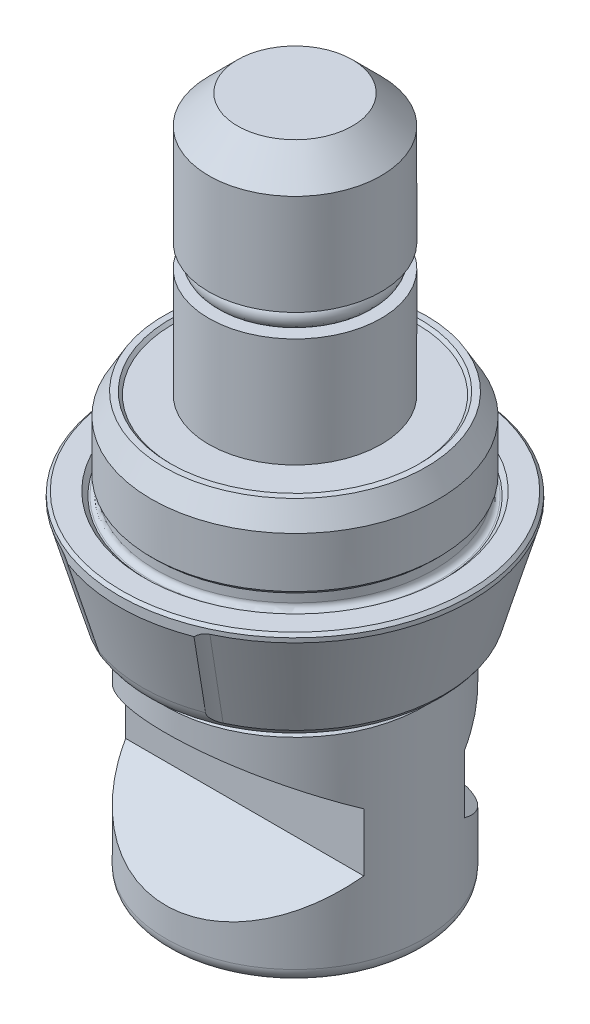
ISO-10303-21;
HEADER;
FILE_DESCRIPTION(('STEP AP214'),'2;1');
FILE_NAME('part.step','',(''),(''),'','','');
FILE_SCHEMA(('AUTOMOTIVE_DESIGN { 1 0 10303 214 1 1 1 1 }'));
ENDSEC;
DATA;
#1=APPLICATION_CONTEXT('core data for automotive mechanical design processes');
#2=APPLICATION_PROTOCOL_DEFINITION('international standard','automotive_design',2000,#1);
#3=PRODUCT_CONTEXT('',#1,'mechanical');
#4=PRODUCT('Part','Part','',(#3));
#5=PRODUCT_RELATED_PRODUCT_CATEGORY('part','',(#4));
#6=PRODUCT_DEFINITION_FORMATION('','',#4);
#7=PRODUCT_DEFINITION_CONTEXT('part definition',#1,'design');
#8=PRODUCT_DEFINITION('design','',#6,#7);
#9=PRODUCT_DEFINITION_SHAPE('','',#8);
#10=(LENGTH_UNIT() NAMED_UNIT(*) SI_UNIT(.MILLI.,.METRE.));
#11=(NAMED_UNIT(*) PLANE_ANGLE_UNIT() SI_UNIT($,.RADIAN.));
#12=(NAMED_UNIT(*) SI_UNIT($,.STERADIAN.) SOLID_ANGLE_UNIT());
#13=UNCERTAINTY_MEASURE_WITH_UNIT(LENGTH_MEASURE(1.E-05),#10,'distance_accuracy_value','');
#14=(GEOMETRIC_REPRESENTATION_CONTEXT(3) GLOBAL_UNCERTAINTY_ASSIGNED_CONTEXT((#13)) GLOBAL_UNIT_ASSIGNED_CONTEXT((#10,
#11,#12)) REPRESENTATION_CONTEXT('',''));
#15=CARTESIAN_POINT('',(0.,0.,0.));
#16=DIRECTION('',(0.,0.,1.));
#17=DIRECTION('',(1.,0.,0.));
#18=AXIS2_PLACEMENT_3D('',#15,#16,#17);
#19=CARTESIAN_POINT('',(15.,-13.2754264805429,3.5));
#20=DIRECTION('',(0.,0.,-1.));
#21=DIRECTION('',(0.,-1.,0.));
#22=AXIS2_PLACEMENT_3D('',#19,#20,#21);
#23=PLANE('',#22);
#24=DIRECTION('',(-1.,0.,0.));
#25=VECTOR('',#24,1.);
#26=CARTESIAN_POINT('',(15.,-13.2754264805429,3.5));
#27=LINE('',#26,#25);
#28=CARTESIAN_POINT('',(8.2915619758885,-13.2754264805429,3.5));
#29=VERTEX_POINT('',#28);
#30=CARTESIAN_POINT('',(-8.2915619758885,-13.2754264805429,3.5));
#31=VERTEX_POINT('',#30);
#32=EDGE_CURVE('E508',#29,#31,#27,.T.);
#33=ORIENTED_EDGE('',*,*,#32,.T.);
#34=DIRECTION('',(0.,1.,0.));
#35=VECTOR('',#34,1.);
#36=CARTESIAN_POINT('',(-8.2915619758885,-21.625,3.5));
#37=LINE('',#36,#35);
#38=CARTESIAN_POINT('',(-8.2915619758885,-17.3245735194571,3.5));
#39=VERTEX_POINT('',#38);
#40=EDGE_CURVE('E488',#39,#31,#37,.T.);
#41=ORIENTED_EDGE('',*,*,#40,.F.);
#42=DIRECTION('',(-1.,0.,0.));
#43=VECTOR('',#42,1.);
#44=CARTESIAN_POINT('',(15.,-17.3245735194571,3.5));
#45=LINE('',#44,#43);
#46=CARTESIAN_POINT('',(8.2915619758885,-17.3245735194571,3.5));
#47=VERTEX_POINT('',#46);
#48=EDGE_CURVE('E505',#47,#39,#45,.T.);
#49=ORIENTED_EDGE('',*,*,#48,.F.);
#50=DIRECTION('',(0.,1.,0.));
#51=VECTOR('',#50,1.);
#52=CARTESIAN_POINT('',(8.2915619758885,-21.625,3.5));
#53=LINE('',#52,#51);
#54=EDGE_CURVE('E31',#29,#47,#53,.F.);
#55=ORIENTED_EDGE('',*,*,#54,.F.);
#56=EDGE_LOOP('',(#33,#41,#49,#55));
#57=FACE_BOUND('',#56,.T.);
#58=ADVANCED_FACE('F16',(#57),#23,.F.);
#59=CARTESIAN_POINT('',(15.,-13.2754264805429,-3.5));
#60=DIRECTION('',(0.,0.,-1.));
#61=DIRECTION('',(0.,-1.,0.));
#62=AXIS2_PLACEMENT_3D('',#59,#60,#61);
#63=PLANE('',#62);
#64=DIRECTION('',(0.,1.,0.));
#65=VECTOR('',#64,1.);
#66=CARTESIAN_POINT('',(8.2915619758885,-21.625,-3.5));
#67=LINE('',#66,#65);
#68=CARTESIAN_POINT('',(8.2915619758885,-13.2754264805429,-3.5));
#69=VERTEX_POINT('',#68);
#70=CARTESIAN_POINT('',(8.2915619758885,-17.3245735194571,-3.5));
#71=VERTEX_POINT('',#70);
#72=EDGE_CURVE('E39',#69,#71,#67,.F.);
#73=ORIENTED_EDGE('',*,*,#72,.T.);
#74=DIRECTION('',(-1.,0.,0.));
#75=VECTOR('',#74,1.);
#76=CARTESIAN_POINT('',(15.,-17.3245735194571,-3.5));
#77=LINE('',#76,#75);
#78=CARTESIAN_POINT('',(-8.2915619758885,-17.3245735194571,-3.5));
#79=VERTEX_POINT('',#78);
#80=EDGE_CURVE('E502',#71,#79,#77,.T.);
#81=ORIENTED_EDGE('',*,*,#80,.T.);
#82=DIRECTION('',(0.,1.,0.));
#83=VECTOR('',#82,1.);
#84=CARTESIAN_POINT('',(-8.2915619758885,-21.625,-3.5));
#85=LINE('',#84,#83);
#86=CARTESIAN_POINT('',(-8.2915619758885,-13.2754264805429,-3.5));
#87=VERTEX_POINT('',#86);
#88=EDGE_CURVE('E480',#79,#87,#85,.T.);
#89=ORIENTED_EDGE('',*,*,#88,.T.);
#90=DIRECTION('',(-1.,0.,0.));
#91=VECTOR('',#90,1.);
#92=CARTESIAN_POINT('',(15.,-13.2754264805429,-3.5));
#93=LINE('',#92,#91);
#94=EDGE_CURVE('E501',#69,#87,#93,.T.);
#95=ORIENTED_EDGE('',*,*,#94,.F.);
#96=EDGE_LOOP('',(#73,#81,#89,#95));
#97=FACE_BOUND('',#96,.T.);
#98=ADVANCED_FACE('F309',(#97),#63,.T.);
#99=CARTESIAN_POINT('',(6.,-8.,0.));
#100=DIRECTION('',(0.,-1.,0.));
#101=DIRECTION('',(0.,0.,-1.));
#102=AXIS2_PLACEMENT_3D('',#99,#100,#101);
#103=PLANE('',#102);
#104=CARTESIAN_POINT('',(0.,-8.,0.));
#105=DIRECTION('',(0.,1.,0.));
#106=DIRECTION('',(0.,0.,-1.));
#107=AXIS2_PLACEMENT_3D('',#104,#105,#106);
#108=CIRCLE('',#107,8.5);
#109=CARTESIAN_POINT('',(0.,-8.,-8.5));
#110=VERTEX_POINT('',#109);
#111=EDGE_CURVE('E358',#110,#110,#108,.T.);
#112=ORIENTED_EDGE('',*,*,#111,.T.);
#113=EDGE_LOOP('',(#112));
#114=FACE_BOUND('',#113,.T.);
#115=CARTESIAN_POINT('',(0.,-8.,0.));
#116=DIRECTION('',(0.,-1.,0.));
#117=DIRECTION('',(0.,0.,-1.));
#118=AXIS2_PLACEMENT_3D('',#115,#116,#117);
#119=CIRCLE('',#118,8.69892881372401);
#120=CARTESIAN_POINT('',(0.,-8.,-8.69892881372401));
#121=VERTEX_POINT('',#120);
#122=EDGE_CURVE('E621',#121,#121,#119,.T.);
#123=ORIENTED_EDGE('',*,*,#122,.T.);
#124=EDGE_LOOP('',(#123));
#125=FACE_BOUND('',#124,.T.);
#126=ADVANCED_FACE('F217',(#114,#125),#103,.T.);
#127=CARTESIAN_POINT('',(0.,0.,0.));
#128=DIRECTION('',(0.,-1.,0.));
#129=DIRECTION('',(0.,0.,-1.));
#130=AXIS2_PLACEMENT_3D('',#127,#128,#129);
#131=CYLINDRICAL_SURFACE('',#130,12.25);
#132=CARTESIAN_POINT('',(0.,-0.2,0.));
#133=DIRECTION('',(0.,1.,0.));
#134=DIRECTION('',(0.,0.,1.));
#135=AXIS2_PLACEMENT_3D('',#132,#133,#134);
#136=CIRCLE('',#135,12.25);
#137=CARTESIAN_POINT('',(0.,-0.2,12.25));
#138=VERTEX_POINT('',#137);
#139=EDGE_CURVE('E608',#138,#138,#136,.F.);
#140=ORIENTED_EDGE('',*,*,#139,.T.);
#141=EDGE_LOOP('',(#140));
#142=FACE_BOUND('',#141,.T.);
#143=CARTESIAN_POINT('',(0.,-0.871853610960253,0.));
#144=DIRECTION('',(0.,-1.,0.));
#145=DIRECTION('',(0.,0.,-1.));
#146=AXIS2_PLACEMENT_3D('',#143,#144,#145);
#147=CIRCLE('',#146,12.25);
#148=CARTESIAN_POINT('',(-4.39878656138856,-0.871853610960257,-11.4329863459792));
#149=VERTEX_POINT('',#148);
#150=CARTESIAN_POINT('',(4.39878656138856,-0.871853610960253,-11.4329863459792));
#151=VERTEX_POINT('',#150);
#152=EDGE_CURVE('E162',#149,#151,#147,.T.);
#153=ORIENTED_EDGE('',*,*,#152,.F.);
#154=CARTESIAN_POINT('',(-4.39878656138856,-0.871853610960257,-11.4329863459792));
#155=CARTESIAN_POINT('',(-4.4487006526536,-0.825854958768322,-11.4137761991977));
#156=CARTESIAN_POINT('',(-4.50068172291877,-0.782151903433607,-11.3934067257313));
#157=CARTESIAN_POINT('',(-4.60975588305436,-0.701193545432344,-11.3497225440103));
#158=CARTESIAN_POINT('',(-4.66692043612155,-0.664059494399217,-11.3263639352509));
#159=CARTESIAN_POINT('',(-4.78616033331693,-0.599553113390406,-11.2764957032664));
#160=CARTESIAN_POINT('',(-4.84827295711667,-0.57226556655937,-11.2499612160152));
#161=CARTESIAN_POINT('',(-4.9753642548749,-0.531494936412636,-11.1943287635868));
#162=CARTESIAN_POINT('',(-5.04031752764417,-0.517908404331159,-11.1652518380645));
#163=CARTESIAN_POINT('',(-5.16333288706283,-0.507133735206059,-11.108849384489));
#164=CARTESIAN_POINT('',(-5.22132828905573,-0.508239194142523,-11.0817070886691));
#165=CARTESIAN_POINT('',(-5.33573672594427,-0.522593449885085,-11.0270780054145));
#166=CARTESIAN_POINT('',(-5.39214584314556,-0.53586998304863,-10.9995905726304));
#167=CARTESIAN_POINT('',(-5.51007430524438,-0.575732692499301,-10.9410494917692));
#168=CARTESIAN_POINT('',(-5.57104431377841,-0.604052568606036,-10.9100979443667));
#169=CARTESIAN_POINT('',(-5.68773746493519,-0.671101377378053,-10.8497235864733));
#170=CARTESIAN_POINT('',(-5.74344936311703,-0.709851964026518,-10.8203041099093));
#171=CARTESIAN_POINT('',(-5.84322510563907,-0.789624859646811,-10.7667068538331));
#172=CARTESIAN_POINT('',(-5.88787737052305,-0.829773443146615,-10.7423308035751));
#173=CARTESIAN_POINT('',(-5.93069015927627,-0.871853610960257,-10.718647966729));
#174=B_SPLINE_CURVE_WITH_KNOTS('',3,(#154,#155,#156,#157,#158,#159,#160,#161,#162,#163,#164,
#165,#166,#167,#168,#169,#170,#171,#172,#173),.UNSPECIFIED.,.F.,.F.,(4,2,2,2,2,2,2,2,2,4),(0.,
0.2119851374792,0.427547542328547,0.644924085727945,0.860646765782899,1.05155694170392,
1.24290326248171,1.4636936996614,1.68494607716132,1.87883393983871),.UNSPECIFIED.);
#175=CARTESIAN_POINT('',(-5.17707370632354,-0.509058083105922,-11.102270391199));
#176=VERTEX_POINT('',#175);
#177=EDGE_CURVE('E144',#149,#176,#174,.T.);
#178=ORIENTED_EDGE('',*,*,#177,.T.);
#179=CARTESIAN_POINT('',(0.,-0.509058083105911,0.));
#180=DIRECTION('',(0.,1.,0.));
#181=DIRECTION('',(0.,0.,1.));
#182=AXIS2_PLACEMENT_3D('',#179,#180,#181);
#183=CIRCLE('',#182,12.25);
#184=CARTESIAN_POINT('',(-5.17707370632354,-0.509058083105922,11.102270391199));
#185=VERTEX_POINT('',#184);
#186=EDGE_CURVE('E160',#185,#176,#183,.F.);
#187=ORIENTED_EDGE('',*,*,#186,.F.);
#188=CARTESIAN_POINT('',(-5.93069015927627,-0.871853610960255,10.718647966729));
#189=CARTESIAN_POINT('',(-5.88389017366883,-0.825854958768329,10.7445363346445));
#190=CARTESIAN_POINT('',(-5.83487346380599,-0.782151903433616,10.7712628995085));
#191=CARTESIAN_POINT('',(-5.73129792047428,-0.70119354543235,10.8267389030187));
#192=CARTESIAN_POINT('',(-5.67665952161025,-0.664059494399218,10.8555148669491));
#193=CARTESIAN_POINT('',(-5.56181231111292,-0.599553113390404,10.9148032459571));
#194=CARTESIAN_POINT('',(-5.50156048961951,-0.57226556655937,10.945328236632));
#195=CARTESIAN_POINT('',(-5.37725084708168,-0.531494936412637,11.006925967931));
#196=CARTESIAN_POINT('',(-5.31322547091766,-0.517908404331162,11.0379927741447));
#197=CARTESIAN_POINT('',(-5.19094593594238,-0.507133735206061,11.0959732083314));
#198=CARTESIAN_POINT('',(-5.13287500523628,-0.508239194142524,11.1229535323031));
#199=CARTESIAN_POINT('',(-5.01748637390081,-0.522593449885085,11.1754805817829));
#200=CARTESIAN_POINT('',(-4.96017069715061,-0.535869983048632,11.2010238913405));
#201=CARTESIAN_POINT('',(-4.83952267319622,-0.575732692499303,11.2537328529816));
#202=CARTESIAN_POINT('',(-4.77662164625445,-0.604052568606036,11.2805433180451));
#203=CARTESIAN_POINT('',(-4.65536329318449,-0.67110137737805,11.3311275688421));
#204=CARTESIAN_POINT('',(-4.59701574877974,-0.709851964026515,11.3548948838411));
#205=CARTESIAN_POINT('',(-4.49182325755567,-0.789624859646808,11.3968758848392));
#206=CARTESIAN_POINT('',(-4.44444819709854,-0.829773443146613,11.4154128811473));
#207=CARTESIAN_POINT('',(-4.39878656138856,-0.871853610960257,11.4329863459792));
#208=B_SPLINE_CURVE_WITH_KNOTS('',3,(#188,#189,#190,#191,#192,#193,#194,#195,#196,#197,#198,
#199,#200,#201,#202,#203,#204,#205,#206,#207),.UNSPECIFIED.,.F.,.F.,(4,2,2,2,2,2,2,2,2,4),(0.,
0.2119851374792,0.427547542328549,0.644924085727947,0.8606467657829,1.05155694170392,
1.24290326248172,1.4636936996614,1.68494607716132,1.87883393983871),.UNSPECIFIED.);
#209=CARTESIAN_POINT('',(-4.39878656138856,-0.871853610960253,11.4329863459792));
#210=VERTEX_POINT('',#209);
#211=EDGE_CURVE('E172',#185,#210,#208,.T.);
#212=ORIENTED_EDGE('',*,*,#211,.T.);
#213=CARTESIAN_POINT('',(4.39878656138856,-0.871853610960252,11.4329863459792));
#214=VERTEX_POINT('',#213);
#215=EDGE_CURVE('E624',#214,#210,#147,.T.);
#216=ORIENTED_EDGE('',*,*,#215,.F.);
#217=CARTESIAN_POINT('',(4.39878656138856,-0.871853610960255,11.4329863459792));
#218=CARTESIAN_POINT('',(4.4487006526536,-0.825854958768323,11.4137761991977));
#219=CARTESIAN_POINT('',(4.50068172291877,-0.782151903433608,11.3934067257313));
#220=CARTESIAN_POINT('',(4.60975588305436,-0.701193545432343,11.3497225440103));
#221=CARTESIAN_POINT('',(4.66692043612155,-0.664059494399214,11.3263639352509));
#222=CARTESIAN_POINT('',(4.78616033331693,-0.599553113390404,11.2764957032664));
#223=CARTESIAN_POINT('',(4.84827295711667,-0.572265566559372,11.2499612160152));
#224=CARTESIAN_POINT('',(4.9753642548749,-0.531494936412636,11.1943287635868));
#225=CARTESIAN_POINT('',(5.04031752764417,-0.517908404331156,11.1652518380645));
#226=CARTESIAN_POINT('',(5.16333288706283,-0.507133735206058,11.108849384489));
#227=CARTESIAN_POINT('',(5.22132828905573,-0.508239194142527,11.0817070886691));
#228=CARTESIAN_POINT('',(5.33573672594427,-0.522593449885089,11.0270780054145));
#229=CARTESIAN_POINT('',(5.39214584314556,-0.53586998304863,10.9995905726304));
#230=CARTESIAN_POINT('',(5.51007430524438,-0.575732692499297,10.9410494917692));
#231=CARTESIAN_POINT('',(5.57104431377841,-0.604052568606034,10.9100979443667));
#232=CARTESIAN_POINT('',(5.68773746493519,-0.671101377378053,10.8497235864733));
#233=CARTESIAN_POINT('',(5.74344936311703,-0.709851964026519,10.8203041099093));
#234=CARTESIAN_POINT('',(5.84322510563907,-0.789624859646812,10.7667068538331));
#235=CARTESIAN_POINT('',(5.88787737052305,-0.829773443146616,10.7423308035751));
#236=CARTESIAN_POINT('',(5.93069015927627,-0.871853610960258,10.718647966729));
#237=B_SPLINE_CURVE_WITH_KNOTS('',3,(#217,#218,#219,#220,#221,#222,#223,#224,#225,#226,#227,
#228,#229,#230,#231,#232,#233,#234,#235,#236),.UNSPECIFIED.,.F.,.F.,(4,2,2,2,2,2,2,2,2,4),(0.,
0.211985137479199,0.427547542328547,0.644924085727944,0.860646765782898,1.05155694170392,
1.24290326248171,1.46369369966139,1.68494607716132,1.87883393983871),.UNSPECIFIED.);
#238=CARTESIAN_POINT('',(5.17707370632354,-0.509058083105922,11.102270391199));
#239=VERTEX_POINT('',#238);
#240=EDGE_CURVE('E204',#214,#239,#237,.T.);
#241=ORIENTED_EDGE('',*,*,#240,.T.);
#242=CARTESIAN_POINT('',(0.,-0.509058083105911,0.));
#243=DIRECTION('',(0.,1.,0.));
#244=DIRECTION('',(0.,0.,1.));
#245=AXIS2_PLACEMENT_3D('',#242,#243,#244);
#246=CIRCLE('',#245,12.25);
#247=CARTESIAN_POINT('',(5.17707370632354,-0.509058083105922,-11.102270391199));
#248=VERTEX_POINT('',#247);
#249=EDGE_CURVE('E639',#248,#239,#246,.F.);
#250=ORIENTED_EDGE('',*,*,#249,.F.);
#251=CARTESIAN_POINT('',(5.93069015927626,-0.871853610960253,-10.718647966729));
#252=CARTESIAN_POINT('',(5.88389017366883,-0.825854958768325,-10.7445363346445));
#253=CARTESIAN_POINT('',(5.83487346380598,-0.782151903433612,-10.7712628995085));
#254=CARTESIAN_POINT('',(5.73129792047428,-0.701193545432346,-10.8267389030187));
#255=CARTESIAN_POINT('',(5.67665952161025,-0.664059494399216,-10.8555148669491));
#256=CARTESIAN_POINT('',(5.56181231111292,-0.599553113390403,-10.9148032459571));
#257=CARTESIAN_POINT('',(5.50156048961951,-0.572265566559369,-10.945328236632));
#258=CARTESIAN_POINT('',(5.37725084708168,-0.531494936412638,-11.006925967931));
#259=CARTESIAN_POINT('',(5.31322547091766,-0.517908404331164,-11.0379927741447));
#260=CARTESIAN_POINT('',(5.19094593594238,-0.507133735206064,-11.0959732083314));
#261=CARTESIAN_POINT('',(5.13287500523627,-0.508239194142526,-11.1229535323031));
#262=CARTESIAN_POINT('',(5.0174863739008,-0.522593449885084,-11.1754805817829));
#263=CARTESIAN_POINT('',(4.96017069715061,-0.535869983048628,-11.2010238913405));
#264=CARTESIAN_POINT('',(4.83952267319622,-0.575732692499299,-11.2537328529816));
#265=CARTESIAN_POINT('',(4.77662164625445,-0.604052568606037,-11.2805433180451));
#266=CARTESIAN_POINT('',(4.65536329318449,-0.671101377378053,-11.3311275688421));
#267=CARTESIAN_POINT('',(4.59701574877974,-0.709851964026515,-11.3548948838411));
#268=CARTESIAN_POINT('',(4.49182325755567,-0.789624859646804,-11.3968758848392));
#269=CARTESIAN_POINT('',(4.44444819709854,-0.829773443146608,-11.4154128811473));
#270=CARTESIAN_POINT('',(4.39878656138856,-0.871853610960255,-11.4329863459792));
#271=B_SPLINE_CURVE_WITH_KNOTS('',3,(#251,#252,#253,#254,#255,#256,#257,#258,#259,#260,#261,
#262,#263,#264,#265,#266,#267,#268,#269,#270),.UNSPECIFIED.,.F.,.F.,(4,2,2,2,2,2,2,2,2,4),(0.,
0.2119851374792,0.427547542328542,0.644924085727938,0.860646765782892,1.05155694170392,
1.24290326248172,1.46369369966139,1.68494607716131,1.8788339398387),.UNSPECIFIED.);
#272=EDGE_CURVE('E226',#248,#151,#271,.T.);
#273=ORIENTED_EDGE('',*,*,#272,.T.);
#274=EDGE_LOOP('',(#153,#178,#187,#212,#216,#241,#250,#273));
#275=FACE_BOUND('',#274,.T.);
#276=ADVANCED_FACE('F158',(#142,#275),#131,.T.);
#277=CARTESIAN_POINT('',(0.,-6.,0.));
#278=DIRECTION('',(0.,-1.,0.));
#279=DIRECTION('',(0.,0.,-1.));
#280=AXIS2_PLACEMENT_3D('',#277,#278,#279);
#281=TOROIDAL_SURFACE('',#280,8.69892881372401,2.);
#282=ORIENTED_EDGE('',*,*,#122,.F.);
#283=EDGE_LOOP('',(#282));
#284=FACE_BOUND('',#283,.T.);
#285=CARTESIAN_POINT('',(0.,-7.12401871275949,0.));
#286=DIRECTION('',(0.,1.,0.));
#287=DIRECTION('',(0.,0.,1.));
#288=AXIS2_PLACEMENT_3D('',#285,#286,#287);
#289=CIRCLE('',#288,10.3531905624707);
#290=CARTESIAN_POINT('',(-4.37544739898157,-7.12401871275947,-9.38317722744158));
#291=VERTEX_POINT('',#290);
#292=CARTESIAN_POINT('',(-4.37544739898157,-7.12401871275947,9.38317722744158));
#293=VERTEX_POINT('',#292);
#294=EDGE_CURVE('E588',#291,#293,#289,.T.);
#295=ORIENTED_EDGE('',*,*,#294,.F.);
#296=CARTESIAN_POINT('',(-5.22522777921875,-6.55107471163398,-9.24734878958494));
#297=CARTESIAN_POINT('',(-5.22145306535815,-6.58220653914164,-9.23927094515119));
#298=CARTESIAN_POINT('',(-5.21435507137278,-6.61308951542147,-9.23213779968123));
#299=CARTESIAN_POINT('',(-5.19436843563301,-6.6730457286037,-9.2200103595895));
#300=CARTESIAN_POINT('',(-5.18153463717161,-6.70213320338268,-9.21499666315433));
#301=CARTESIAN_POINT('',(-5.15086771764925,-6.75774417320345,-9.20720820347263));
#302=CARTESIAN_POINT('',(-5.13304604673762,-6.78427335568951,-9.20442836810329));
#303=CARTESIAN_POINT('',(-5.09341336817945,-6.83436257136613,-9.20109312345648));
#304=CARTESIAN_POINT('',(-5.07159388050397,-6.85791610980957,-9.20054250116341));
#305=CARTESIAN_POINT('',(-5.01945828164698,-6.90698991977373,-9.20172800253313));
#306=CARTESIAN_POINT('',(-4.98835377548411,-6.93165469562,-9.2040366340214));
#307=CARTESIAN_POINT('',(-4.92319655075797,-6.97611481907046,-9.21170834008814));
#308=CARTESIAN_POINT('',(-4.88913951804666,-6.99590287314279,-9.21707595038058));
#309=CARTESIAN_POINT('',(-4.8079162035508,-7.03659770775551,-9.23279581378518));
#310=CARTESIAN_POINT('',(-4.76008954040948,-7.05577425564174,-9.24420159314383));
#311=CARTESIAN_POINT('',(-4.66335295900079,-7.08685772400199,-9.27131061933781));
#312=CARTESIAN_POINT('',(-4.61444224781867,-7.09875912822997,-9.2870171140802));
#313=CARTESIAN_POINT('',(-4.51584800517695,-7.11604743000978,-9.32259217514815));
#314=CARTESIAN_POINT('',(-4.46616894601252,-7.12129715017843,-9.34253877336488));
#315=CARTESIAN_POINT('',(-4.36806629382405,-7.12511387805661,-9.3859488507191));
#316=CARTESIAN_POINT('',(-4.31964395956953,-7.12367442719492,-9.40941570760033));
#317=CARTESIAN_POINT('',(-4.2170288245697,-7.11320953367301,-9.46364184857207));
#318=CARTESIAN_POINT('',(-4.16325216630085,-7.10293758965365,-9.49496279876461));
#319=CARTESIAN_POINT('',(-4.06070130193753,-7.07238633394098,-9.56078526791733));
#320=CARTESIAN_POINT('',(-4.01191754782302,-7.05212657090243,-9.59528046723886));
#321=CARTESIAN_POINT('',(-3.93859903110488,-7.00996088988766,-9.65273912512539));
#322=CARTESIAN_POINT('',(-3.91176335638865,-6.99142736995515,-9.67525554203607));
#323=CARTESIAN_POINT('',(-3.86204889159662,-6.94957563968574,-9.72020320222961));
#324=CARTESIAN_POINT('',(-3.83916297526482,-6.92626621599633,-9.74263452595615));
#325=CARTESIAN_POINT('',(-3.8023500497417,-6.87962572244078,-9.7822839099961));
#326=CARTESIAN_POINT('',(-3.78754695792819,-6.85714273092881,-9.79968178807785));
#327=CARTESIAN_POINT('',(-3.76196274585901,-6.8090446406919,-9.83312992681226));
#328=CARTESIAN_POINT('',(-3.75118211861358,-6.78342915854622,-9.84918002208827));
#329=CARTESIAN_POINT('',(-3.73426062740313,-6.72926507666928,-9.8792704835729));
#330=CARTESIAN_POINT('',(-3.7281617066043,-6.70069250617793,-9.89329178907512));
#331=CARTESIAN_POINT('',(-3.72131021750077,-6.64170058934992,-9.91831536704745));
#332=CARTESIAN_POINT('',(-3.72054148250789,-6.61128710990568,-9.92932667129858));
#333=CARTESIAN_POINT('',(-3.7231007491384,-6.57075805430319,-9.94150143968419));
#334=CARTESIAN_POINT('',(-3.72399575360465,-6.56092162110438,-9.94426529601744));
#335=CARTESIAN_POINT('',(-3.72516847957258,-6.551074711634,-9.94683792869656));
#336=B_SPLINE_CURVE_WITH_KNOTS('',3,(#296,#297,#298,#299,#300,#301,#302,#303,#304,#305,#306,
#307,#308,#309,#310,#311,#312,#313,#314,#315,#316,#317,#318,#319,#320,#321,#322,#323,#324,#325,
#326,#327,#328,#329,#330,#331,#332,#333,#334,#335),.UNSPECIFIED.,.F.,.F.,(4,2,2,2,2,2,2,2,2,2,2,
2,2,2,2,2,2,2,2,4),(0.,0.0968495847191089,0.192792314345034,0.288516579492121,0.384446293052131,
0.503097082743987,0.621924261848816,0.779407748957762,0.937010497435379,1.09781322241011,
1.25877123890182,1.4470577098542,1.63497711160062,1.75348208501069,1.87177096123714,
1.96755173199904,2.06334423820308,2.15998523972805,2.25633299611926,2.2870796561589),.UNSPECIFIED.);
#337=CARTESIAN_POINT('',(-3.72514478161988,-6.55127471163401,-9.94678557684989));
#338=VERTEX_POINT('',#337);
#339=EDGE_CURVE('E147',#291,#338,#336,.T.);
#340=ORIENTED_EDGE('',*,*,#339,.T.);
#341=CARTESIAN_POINT('',(0.,-6.55127471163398,0.));
#342=DIRECTION('',(0.,-1.,0.));
#343=DIRECTION('',(0.,0.,-1.));
#344=AXIS2_PLACEMENT_3D('',#341,#342,#343);
#345=CIRCLE('',#344,10.6214522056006);
#346=CARTESIAN_POINT('',(3.7251447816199,-6.55127471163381,-9.94678557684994));
#347=VERTEX_POINT('',#346);
#348=EDGE_CURVE('E617',#347,#338,#345,.F.);
#349=ORIENTED_EDGE('',*,*,#348,.F.);
#350=CARTESIAN_POINT('',(3.72516847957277,-6.55107471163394,-9.94683792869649));
#351=CARTESIAN_POINT('',(3.72140683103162,-6.5822065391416,-9.93875399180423));
#352=CARTESIAN_POINT('',(3.72050502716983,-6.61308951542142,-9.92873151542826));
#353=CARTESIAN_POINT('',(3.72406203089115,-6.67304572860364,-9.90562549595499));
#354=CARTESIAN_POINT('',(3.72847072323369,-6.70213320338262,-9.89257149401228));
#355=CARTESIAN_POINT('',(3.74221673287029,-6.7577441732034,-9.86407294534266));
#356=CARTESIAN_POINT('',(3.75154280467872,-6.78427335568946,-9.84863390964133));
#357=CARTESIAN_POINT('',(3.77446325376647,-6.83436257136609,-9.81612966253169));
#358=CARTESIAN_POINT('',(3.78806674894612,-6.85791610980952,-9.79906103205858));
#359=CARTESIAN_POINT('',(3.82248701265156,-6.90698991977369,-9.75988487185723));
#360=CARTESIAN_POINT('',(3.84424911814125,-6.93165469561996,-9.73754139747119));
#361=CARTESIAN_POINT('',(3.89200824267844,-6.97611481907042,-9.69255934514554));
#362=CARTESIAN_POINT('',(3.9180115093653,-6.99590287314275,-9.66992037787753));
#363=CARTESIAN_POINT('',(3.98226296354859,-7.03659770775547,-9.61780424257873));
#364=CARTESIAN_POINT('',(4.0217426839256,-7.05577425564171,-9.58849838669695));
#365=CARTESIAN_POINT('',(4.10469047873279,-7.08685772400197,-9.53181921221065));
#366=CARTESIAN_POINT('',(4.14816155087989,-7.09875912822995,-9.5044473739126));
#367=CARTESIAN_POINT('',(4.23878878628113,-7.11604743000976,-9.45178701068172));
#368=CARTESIAN_POINT('',(4.28600185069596,-7.12129715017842,-9.42655206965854));
#369=CARTESIAN_POINT('',(4.38231506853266,-7.12511387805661,-9.37930453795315));
#370=CARTESIAN_POINT('',(4.43141700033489,-7.12367442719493,-9.35729508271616));
#371=CARTESIAN_POINT('',(4.53891637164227,-7.11320953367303,-9.31354322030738));
#372=CARTESIAN_POINT('',(4.59747658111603,-7.10293758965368,-9.2924806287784));
#373=CARTESIAN_POINT('',(4.71381794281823,-7.07238633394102,-9.25623197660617));
#374=CARTESIAN_POINT('',(4.77160039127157,-7.05212657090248,-9.24103453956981));
#375=CARTESIAN_POINT('',(4.86274451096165,-7.00996088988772,-9.22180301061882));
#376=CARTESIAN_POINT('',(4.89724272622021,-6.99142736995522,-9.21571896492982));
#377=CARTESIAN_POINT('',(4.9636304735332,-6.94957563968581,-9.20652727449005));
#378=CARTESIAN_POINT('',(4.99552464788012,-6.9262662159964,-9.20341422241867));
#379=CARTESIAN_POINT('',(5.0495607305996,-6.87962572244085,-9.20070001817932));
#380=CARTESIAN_POINT('',(5.07240352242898,-6.85714273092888,-9.20054333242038));
#381=CARTESIAN_POINT('',(5.11447149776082,-6.80904464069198,-9.20244473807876));
#382=CARTESIAN_POINT('',(5.13369623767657,-6.7834291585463,-9.20450310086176));
#383=CARTESIAN_POINT('',(5.16762379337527,-6.72926507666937,-9.21088226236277));
#384=CARTESIAN_POINT('',(5.18228504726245,-6.70069250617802,-9.21522293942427));
#385=CARTESIAN_POINT('',(5.20585827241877,-6.64170058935,-9.22605924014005));
#386=CARTESIAN_POINT('',(5.21478755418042,-6.61128710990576,-9.23254828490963));
#387=CARTESIAN_POINT('',(5.22246890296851,-6.57075805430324,-9.24233458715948));
#388=CARTESIAN_POINT('',(5.22401084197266,-6.56092162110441,-9.24479677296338));
#389=CARTESIAN_POINT('',(5.22522777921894,-6.551074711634,-9.24734878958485));
#390=B_SPLINE_CURVE_WITH_KNOTS('',3,(#350,#351,#352,#353,#354,#355,#356,#357,#358,#359,#360,
#361,#362,#363,#364,#365,#366,#367,#368,#369,#370,#371,#372,#373,#374,#375,#376,#377,#378,#379,
#380,#381,#382,#383,#384,#385,#386,#387,#388,#389),.UNSPECIFIED.,.F.,.F.,(4,2,2,2,2,2,2,2,2,2,2,
2,2,2,2,2,2,2,2,4),(0.,0.0968495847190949,0.192792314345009,0.288516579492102,0.384446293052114,
0.503097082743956,0.621924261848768,0.779407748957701,0.937010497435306,1.09781322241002,
1.25877123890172,1.44705770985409,1.63497711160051,1.7534820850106,1.87177096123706,
1.96755173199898,2.06334423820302,2.159985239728,2.25633299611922,2.28707965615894),.UNSPECIFIED.);
#391=CARTESIAN_POINT('',(4.37544739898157,-7.12401871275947,-9.38317722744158));
#392=VERTEX_POINT('',#391);
#393=EDGE_CURVE('E648',#347,#392,#390,.T.);
#394=ORIENTED_EDGE('',*,*,#393,.T.);
#395=CARTESIAN_POINT('',(0.,-7.12401871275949,0.));
#396=DIRECTION('',(0.,1.,0.));
#397=DIRECTION('',(0.,0.,1.));
#398=AXIS2_PLACEMENT_3D('',#395,#396,#397);
#399=CIRCLE('',#398,10.3531905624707);
#400=CARTESIAN_POINT('',(4.37544739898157,-7.12401871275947,9.38317722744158));
#401=VERTEX_POINT('',#400);
#402=EDGE_CURVE('E591',#401,#392,#399,.T.);
#403=ORIENTED_EDGE('',*,*,#402,.F.);
#404=CARTESIAN_POINT('',(5.22522777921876,-6.55107471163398,9.24734878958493));
#405=CARTESIAN_POINT('',(5.22145306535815,-6.58220653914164,9.23927094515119));
#406=CARTESIAN_POINT('',(5.21435507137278,-6.61308951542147,9.23213779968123));
#407=CARTESIAN_POINT('',(5.19436843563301,-6.6730457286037,9.2200103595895));
#408=CARTESIAN_POINT('',(5.18153463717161,-6.70213320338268,9.21499666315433));
#409=CARTESIAN_POINT('',(5.15086771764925,-6.75774417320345,9.20720820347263));
#410=CARTESIAN_POINT('',(5.13304604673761,-6.78427335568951,9.20442836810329));
#411=CARTESIAN_POINT('',(5.09341336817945,-6.83436257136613,9.20109312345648));
#412=CARTESIAN_POINT('',(5.07159388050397,-6.85791610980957,9.20054250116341));
#413=CARTESIAN_POINT('',(5.01945828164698,-6.90698991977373,9.20172800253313));
#414=CARTESIAN_POINT('',(4.98835377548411,-6.93165469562,9.2040366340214));
#415=CARTESIAN_POINT('',(4.92319655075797,-6.97611481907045,9.21170834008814));
#416=CARTESIAN_POINT('',(4.88913951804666,-6.99590287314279,9.21707595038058));
#417=CARTESIAN_POINT('',(4.8079162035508,-7.03659770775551,9.23279581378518));
#418=CARTESIAN_POINT('',(4.76008954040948,-7.05577425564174,9.24420159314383));
#419=CARTESIAN_POINT('',(4.66335295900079,-7.08685772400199,9.27131061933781));
#420=CARTESIAN_POINT('',(4.61444224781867,-7.09875912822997,9.2870171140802));
#421=CARTESIAN_POINT('',(4.51584800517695,-7.11604743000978,9.32259217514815));
#422=CARTESIAN_POINT('',(4.46616894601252,-7.12129715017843,9.34253877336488));
#423=CARTESIAN_POINT('',(4.36806629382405,-7.12511387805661,9.3859488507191));
#424=CARTESIAN_POINT('',(4.31964395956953,-7.12367442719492,9.40941570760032));
#425=CARTESIAN_POINT('',(4.2170288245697,-7.11320953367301,9.46364184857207));
#426=CARTESIAN_POINT('',(4.16325216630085,-7.10293758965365,9.49496279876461));
#427=CARTESIAN_POINT('',(4.06070130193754,-7.07238633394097,9.56078526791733));
#428=CARTESIAN_POINT('',(4.01191754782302,-7.05212657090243,9.59528046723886));
#429=CARTESIAN_POINT('',(3.93859903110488,-7.00996088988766,9.65273912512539));
#430=CARTESIAN_POINT('',(3.91176335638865,-6.99142736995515,9.67525554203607));
#431=CARTESIAN_POINT('',(3.86204889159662,-6.94957563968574,9.72020320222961));
#432=CARTESIAN_POINT('',(3.83916297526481,-6.92626621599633,9.74263452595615));
#433=CARTESIAN_POINT('',(3.80235004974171,-6.87962572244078,9.7822839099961));
#434=CARTESIAN_POINT('',(3.78754695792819,-6.8571427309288,9.79968178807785));
#435=CARTESIAN_POINT('',(3.76196274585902,-6.8090446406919,9.83312992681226));
#436=CARTESIAN_POINT('',(3.75118211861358,-6.78342915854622,9.84918002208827));
#437=CARTESIAN_POINT('',(3.73426062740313,-6.72926507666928,9.8792704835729));
#438=CARTESIAN_POINT('',(3.72816170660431,-6.70069250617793,9.89329178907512));
#439=CARTESIAN_POINT('',(3.72131021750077,-6.64170058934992,9.91831536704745));
#440=CARTESIAN_POINT('',(3.72054148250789,-6.61128710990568,9.92932667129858));
#441=CARTESIAN_POINT('',(3.7231007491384,-6.57075805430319,9.94150143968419));
#442=CARTESIAN_POINT('',(3.72399575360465,-6.56092162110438,9.94426529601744));
#443=CARTESIAN_POINT('',(3.72516847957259,-6.551074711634,9.94683792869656));
#444=B_SPLINE_CURVE_WITH_KNOTS('',3,(#404,#405,#406,#407,#408,#409,#410,#411,#412,#413,#414,
#415,#416,#417,#418,#419,#420,#421,#422,#423,#424,#425,#426,#427,#428,#429,#430,#431,#432,#433,
#434,#435,#436,#437,#438,#439,#440,#441,#442,#443),.UNSPECIFIED.,.F.,.F.,(4,2,2,2,2,2,2,2,2,2,2,
2,2,2,2,2,2,2,2,4),(0.,0.0968495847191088,0.192792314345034,0.288516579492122,0.384446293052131,
0.503097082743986,0.621924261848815,0.779407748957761,0.937010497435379,1.09781322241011,
1.25877123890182,1.4470577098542,1.63497711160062,1.75348208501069,1.87177096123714,
1.96755173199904,2.06334423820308,2.15998523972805,2.25633299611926,2.28707965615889),.UNSPECIFIED.);
#445=CARTESIAN_POINT('',(3.72514478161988,-6.55127471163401,9.94678557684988));
#446=VERTEX_POINT('',#445);
#447=EDGE_CURVE('E167',#401,#446,#444,.T.);
#448=ORIENTED_EDGE('',*,*,#447,.T.);
#449=CARTESIAN_POINT('',(-3.7251447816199,-6.55127471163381,9.94678557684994));
#450=VERTEX_POINT('',#449);
#451=EDGE_CURVE('E620',#450,#446,#345,.F.);
#452=ORIENTED_EDGE('',*,*,#451,.F.);
#453=CARTESIAN_POINT('',(-3.72516847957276,-6.55107471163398,9.94683792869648));
#454=CARTESIAN_POINT('',(-3.72140683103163,-6.58220653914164,9.93875399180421));
#455=CARTESIAN_POINT('',(-3.72050502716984,-6.61308951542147,9.92873151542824));
#456=CARTESIAN_POINT('',(-3.72406203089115,-6.6730457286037,9.90562549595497));
#457=CARTESIAN_POINT('',(-3.7284707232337,-6.70213320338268,9.89257149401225));
#458=CARTESIAN_POINT('',(-3.7422167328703,-6.75774417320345,9.86407294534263));
#459=CARTESIAN_POINT('',(-3.75154280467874,-6.78427335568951,9.84863390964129));
#460=CARTESIAN_POINT('',(-3.7744632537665,-6.83436257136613,9.81612966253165));
#461=CARTESIAN_POINT('',(-3.78806674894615,-6.85791610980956,9.79906103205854));
#462=CARTESIAN_POINT('',(-3.82248701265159,-6.90698991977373,9.75988487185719));
#463=CARTESIAN_POINT('',(-3.84424911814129,-6.93165469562,9.73754139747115));
#464=CARTESIAN_POINT('',(-3.89200824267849,-6.97611481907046,9.6925593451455));
#465=CARTESIAN_POINT('',(-3.91801150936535,-6.99590287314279,9.66992037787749));
#466=CARTESIAN_POINT('',(-3.98226296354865,-7.03659770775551,9.61780424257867));
#467=CARTESIAN_POINT('',(-4.02174268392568,-7.05577425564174,9.5884983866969));
#468=CARTESIAN_POINT('',(-4.10469047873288,-7.08685772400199,9.53181921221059));
#469=CARTESIAN_POINT('',(-4.14816155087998,-7.09875912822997,9.50444737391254));
#470=CARTESIAN_POINT('',(-4.23878878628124,-7.11604743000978,9.45178701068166));
#471=CARTESIAN_POINT('',(-4.28600185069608,-7.12129715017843,9.42655206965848));
#472=CARTESIAN_POINT('',(-4.38231506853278,-7.12511387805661,9.3793045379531));
#473=CARTESIAN_POINT('',(-4.43141700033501,-7.12367442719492,9.35729508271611));
#474=CARTESIAN_POINT('',(-4.5389163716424,-7.11320953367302,9.31354322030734));
#475=CARTESIAN_POINT('',(-4.59747658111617,-7.10293758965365,9.29248062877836));
#476=CARTESIAN_POINT('',(-4.71381794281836,-7.07238633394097,9.25623197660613));
#477=CARTESIAN_POINT('',(-4.7716003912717,-7.05212657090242,9.24103453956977));
#478=CARTESIAN_POINT('',(-4.86274451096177,-7.00996088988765,9.22180301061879));
#479=CARTESIAN_POINT('',(-4.89724272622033,-6.99142736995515,9.2157189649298));
#480=CARTESIAN_POINT('',(-4.9636304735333,-6.94957563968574,9.20652727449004));
#481=CARTESIAN_POINT('',(-4.99552464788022,-6.92626621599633,9.20341422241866));
#482=CARTESIAN_POINT('',(-5.04956073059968,-6.87962572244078,9.20070001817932));
#483=CARTESIAN_POINT('',(-5.07240352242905,-6.85714273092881,9.20054333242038));
#484=CARTESIAN_POINT('',(-5.11447149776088,-6.8090446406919,9.20244473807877));
#485=CARTESIAN_POINT('',(-5.13369623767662,-6.78342915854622,9.20450310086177));
#486=CARTESIAN_POINT('',(-5.1676237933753,-6.72926507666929,9.21088226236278));
#487=CARTESIAN_POINT('',(-5.18228504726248,-6.70069250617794,9.21522293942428));
#488=CARTESIAN_POINT('',(-5.2058582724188,-6.64170058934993,9.22605924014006));
#489=CARTESIAN_POINT('',(-5.21478755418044,-6.6112871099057,9.23254828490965));
#490=CARTESIAN_POINT('',(-5.22246890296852,-6.5707580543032,9.24233458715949));
#491=CARTESIAN_POINT('',(-5.22401084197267,-6.56092162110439,9.24479677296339));
#492=CARTESIAN_POINT('',(-5.22522777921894,-6.551074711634,9.24734878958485));
#493=B_SPLINE_CURVE_WITH_KNOTS('',3,(#453,#454,#455,#456,#457,#458,#459,#460,#461,#462,#463,
#464,#465,#466,#467,#468,#469,#470,#471,#472,#473,#474,#475,#476,#477,#478,#479,#480,#481,#482,
#483,#484,#485,#486,#487,#488,#489,#490,#491,#492),.UNSPECIFIED.,.F.,.F.,(4,2,2,2,2,2,2,2,2,2,2,
2,2,2,2,2,2,2,2,4),(0.,0.0968495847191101,0.192792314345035,0.288516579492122,0.384446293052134,
0.503097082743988,0.621924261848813,0.77940774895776,0.93701049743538,1.09781322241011,
1.25877123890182,1.44705770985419,1.63497711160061,1.75348208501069,1.87177096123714,
1.96755173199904,2.06334423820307,2.15998523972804,2.25633299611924,2.28707965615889),.UNSPECIFIED.);
#494=EDGE_CURVE('E152',#450,#293,#493,.T.);
#495=ORIENTED_EDGE('',*,*,#494,.T.);
#496=EDGE_LOOP('',(#295,#340,#349,#394,#403,#448,#452,#495));
#497=FACE_BOUND('',#496,.T.);
#498=ADVANCED_FACE('F188',(#284,#497),#281,.T.);
#499=CARTESIAN_POINT('',(0.,-8.,0.));
#500=DIRECTION('',(0.,1.,0.));
#501=DIRECTION('',(0.,0.,1.));
#502=AXIS2_PLACEMENT_3D('',#499,#500,#501);
#503=CONICAL_SURFACE('',#502,10.2060369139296,0.279252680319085);
#504=ORIENTED_EDGE('',*,*,#348,.T.);
#505=CARTESIAN_POINT('',(-3.72512112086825,-6.55147471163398,-9.94673319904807));
#506=CARTESIAN_POINT('',(-3.83712658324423,-5.60485263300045,-10.1946323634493));
#507=CARTESIAN_POINT('',(-3.94927008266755,-4.65822316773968,-10.4424407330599));
#508=CARTESIAN_POINT('',(-4.17383315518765,-2.76494946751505,-10.9378758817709));
#509=CARTESIAN_POINT('',(-4.28625272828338,-1.81830523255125,-11.1855026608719));
#510=CARTESIAN_POINT('',(-4.39881033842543,-0.871653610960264,-11.433038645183));
#511=B_SPLINE_CURVE_WITH_KNOTS('',3,(#505,#506,#507,#508,#509,#510),.UNSPECIFIED.,.F.,.F.,(4,2,
4),(0.,2.9547982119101,5.90959641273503),.UNSPECIFIED.);
#512=EDGE_CURVE('E153',#338,#149,#511,.T.);
#513=ORIENTED_EDGE('',*,*,#512,.T.);
#514=ORIENTED_EDGE('',*,*,#152,.T.);
#515=CARTESIAN_POINT('',(4.39881033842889,-0.871653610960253,-11.4330386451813));
#516=CARTESIAN_POINT('',(4.28625272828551,-1.81830523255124,-11.1855026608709));
#517=CARTESIAN_POINT('',(4.17383315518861,-2.76494946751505,-10.9378758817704));
#518=CARTESIAN_POINT('',(3.94927008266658,-4.65822316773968,-10.4424407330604));
#519=CARTESIAN_POINT('',(3.83712658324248,-5.60485263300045,-10.1946323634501));
#520=CARTESIAN_POINT('',(3.7251211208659,-6.55147471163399,-9.94673319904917));
#521=B_SPLINE_CURVE_WITH_KNOTS('',3,(#515,#516,#517,#518,#519,#520),.UNSPECIFIED.,.F.,.F.,(4,2,
4),(0.,2.95479820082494,5.90959641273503),.UNSPECIFIED.);
#522=EDGE_CURVE('E645',#151,#347,#521,.T.);
#523=ORIENTED_EDGE('',*,*,#522,.T.);
#524=EDGE_LOOP('',(#504,#513,#514,#523));
#525=FACE_BOUND('',#524,.T.);
#526=ADVANCED_FACE('F219',(#525),#503,.T.);
#527=ORIENTED_EDGE('',*,*,#215,.T.);
#528=CARTESIAN_POINT('',(-4.3988103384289,-0.871653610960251,11.4330386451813));
#529=CARTESIAN_POINT('',(-4.28625272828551,-1.81830523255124,11.1855026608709));
#530=CARTESIAN_POINT('',(-4.17383315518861,-2.76494946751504,10.9378758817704));
#531=CARTESIAN_POINT('',(-3.94927008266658,-4.65822316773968,10.4424407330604));
#532=CARTESIAN_POINT('',(-3.83712658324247,-5.60485263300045,10.1946323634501));
#533=CARTESIAN_POINT('',(-3.7251211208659,-6.55147471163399,9.94673319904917));
#534=B_SPLINE_CURVE_WITH_KNOTS('',3,(#528,#529,#530,#531,#532,#533),.UNSPECIFIED.,.F.,.F.,(4,2,
4),(0.,2.95479820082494,5.90959641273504),.UNSPECIFIED.);
#535=EDGE_CURVE('E239',#210,#450,#534,.T.);
#536=ORIENTED_EDGE('',*,*,#535,.T.);
#537=ORIENTED_EDGE('',*,*,#451,.T.);
#538=CARTESIAN_POINT('',(3.72512112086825,-6.55147471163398,9.94673319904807));
#539=CARTESIAN_POINT('',(3.83712658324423,-5.60485263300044,10.1946323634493));
#540=CARTESIAN_POINT('',(3.94927008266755,-4.65822316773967,10.4424407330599));
#541=CARTESIAN_POINT('',(4.17383315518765,-2.76494946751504,10.9378758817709));
#542=CARTESIAN_POINT('',(4.28625272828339,-1.81830523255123,11.1855026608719));
#543=CARTESIAN_POINT('',(4.39881033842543,-0.871653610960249,11.433038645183));
#544=B_SPLINE_CURVE_WITH_KNOTS('',3,(#538,#539,#540,#541,#542,#543),.UNSPECIFIED.,.F.,.F.,(4,2,
4),(0.,2.95479821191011,5.90959641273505),.UNSPECIFIED.);
#545=EDGE_CURVE('E170',#446,#214,#544,.T.);
#546=ORIENTED_EDGE('',*,*,#545,.T.);
#547=EDGE_LOOP('',(#527,#536,#537,#546));
#548=FACE_BOUND('',#547,.T.);
#549=ADVANCED_FACE('F670',(#548),#503,.T.);
#550=CARTESIAN_POINT('',(0.,0.,0.));
#551=DIRECTION('',(0.,-1.,0.));
#552=DIRECTION('',(0.,0.,-1.));
#553=AXIS2_PLACEMENT_3D('',#550,#551,#552);
#554=CYLINDRICAL_SURFACE('',#553,10.);
#555=CARTESIAN_POINT('',(0.,1.,0.));
#556=DIRECTION('',(0.,-1.,0.));
#557=DIRECTION('',(0.,0.,-1.));
#558=AXIS2_PLACEMENT_3D('',#555,#556,#557);
#559=CIRCLE('',#558,10.);
#560=CARTESIAN_POINT('',(0.,1.,-10.));
#561=VERTEX_POINT('',#560);
#562=EDGE_CURVE('E636',#561,#561,#559,.T.);
#563=ORIENTED_EDGE('',*,*,#562,.F.);
#564=EDGE_LOOP('',(#563));
#565=FACE_BOUND('',#564,.T.);
#566=CARTESIAN_POINT('',(0.,4.5,0.));
#567=DIRECTION('',(0.,1.,0.));
#568=DIRECTION('',(0.,0.,1.));
#569=AXIS2_PLACEMENT_3D('',#566,#567,#568);
#570=CIRCLE('',#569,10.);
#571=CARTESIAN_POINT('',(0.,4.5,10.));
#572=VERTEX_POINT('',#571);
#573=EDGE_CURVE('E614',#572,#572,#570,.F.);
#574=ORIENTED_EDGE('',*,*,#573,.T.);
#575=EDGE_LOOP('',(#574));
#576=FACE_BOUND('',#575,.T.);
#577=ADVANCED_FACE('F723',(#565,#576),#554,.T.);
#578=CARTESIAN_POINT('',(10.,0.,0.));
#579=DIRECTION('',(0.,1.,0.));
#580=DIRECTION('',(0.,0.,1.));
#581=AXIS2_PLACEMENT_3D('',#578,#579,#580);
#582=PLANE('',#581);
#583=CARTESIAN_POINT('',(0.,0.,0.));
#584=DIRECTION('',(0.,-1.,0.));
#585=DIRECTION('',(0.,0.,-1.));
#586=AXIS2_PLACEMENT_3D('',#583,#584,#585);
#587=CIRCLE('',#586,10.5);
#588=CARTESIAN_POINT('',(0.,0.,-10.5));
#589=VERTEX_POINT('',#588);
#590=EDGE_CURVE('E627',#589,#589,#587,.T.);
#591=ORIENTED_EDGE('',*,*,#590,.T.);
#592=EDGE_LOOP('',(#591));
#593=FACE_BOUND('',#592,.T.);
#594=CARTESIAN_POINT('',(0.,0.,0.));
#595=DIRECTION('',(0.,1.,0.));
#596=DIRECTION('',(0.,0.,1.));
#597=AXIS2_PLACEMENT_3D('',#594,#595,#596);
#598=CIRCLE('',#597,12.05);
#599=CARTESIAN_POINT('',(0.,0.,12.05));
#600=VERTEX_POINT('',#599);
#601=EDGE_CURVE('E605',#600,#600,#598,.T.);
#602=ORIENTED_EDGE('',*,*,#601,.T.);
#603=EDGE_LOOP('',(#602));
#604=FACE_BOUND('',#603,.T.);
#605=ADVANCED_FACE('F222',(#593,#604),#582,.T.);
#606=CARTESIAN_POINT('',(6.,6.,0.));
#607=DIRECTION('',(0.,1.,0.));
#608=DIRECTION('',(0.,0.,1.));
#609=AXIS2_PLACEMENT_3D('',#606,#607,#608);
#610=PLANE('',#609);
#611=CARTESIAN_POINT('',(0.,6.,0.));
#612=DIRECTION('',(0.,1.,0.));
#613=DIRECTION('',(0.,0.,1.));
#614=AXIS2_PLACEMENT_3D('',#611,#612,#613);
#615=CIRCLE('',#614,8.7);
#616=CARTESIAN_POINT('',(0.,6.,8.7));
#617=VERTEX_POINT('',#616);
#618=EDGE_CURVE('E585',#617,#617,#615,.F.);
#619=ORIENTED_EDGE('',*,*,#618,.T.);
#620=EDGE_LOOP('',(#619));
#621=FACE_BOUND('',#620,.T.);
#622=CARTESIAN_POINT('',(0.,6.,0.));
#623=DIRECTION('',(0.,1.,0.));
#624=DIRECTION('',(0.,0.,1.));
#625=AXIS2_PLACEMENT_3D('',#622,#623,#624);
#626=CIRCLE('',#625,9.13397459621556);
#627=CARTESIAN_POINT('',(0.,6.,9.13397459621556));
#628=VERTEX_POINT('',#627);
#629=EDGE_CURVE('E611',#628,#628,#626,.T.);
#630=ORIENTED_EDGE('',*,*,#629,.T.);
#631=EDGE_LOOP('',(#630));
#632=FACE_BOUND('',#631,.T.);
#633=ADVANCED_FACE('F701',(#621,#632),#610,.T.);
#634=CARTESIAN_POINT('',(0.,4.5,0.));
#635=DIRECTION('',(0.,-1.,0.));
#636=DIRECTION('',(0.,0.,-1.));
#637=AXIS2_PLACEMENT_3D('',#634,#635,#636);
#638=CONICAL_SURFACE('',#637,10.,0.523598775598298);
#639=ORIENTED_EDGE('',*,*,#629,.F.);
#640=EDGE_LOOP('',(#639));
#641=FACE_BOUND('',#640,.T.);
#642=ORIENTED_EDGE('',*,*,#573,.F.);
#643=EDGE_LOOP('',(#642));
#644=FACE_BOUND('',#643,.T.);
#645=ADVANCED_FACE('F703',(#641,#644),#638,.T.);
#646=CARTESIAN_POINT('',(0.,-0.2,0.));
#647=DIRECTION('',(0.,-1.,0.));
#648=DIRECTION('',(0.,0.,-1.));
#649=AXIS2_PLACEMENT_3D('',#646,#647,#648);
#650=CONICAL_SURFACE('',#649,12.25,0.785398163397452);
#651=ORIENTED_EDGE('',*,*,#601,.F.);
#652=EDGE_LOOP('',(#651));
#653=FACE_BOUND('',#652,.T.);
#654=ORIENTED_EDGE('',*,*,#139,.F.);
#655=EDGE_LOOP('',(#654));
#656=FACE_BOUND('',#655,.T.);
#657=ADVANCED_FACE('F699',(#653,#656),#650,.T.);
#658=CARTESIAN_POINT('',(0.,-0.3,0.));
#659=DIRECTION('',(0.,1.,0.));
#660=DIRECTION('',(0.,0.,1.));
#661=AXIS2_PLACEMENT_3D('',#658,#659,#660);
#662=CONICAL_SURFACE('',#661,10.2,0.785398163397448);
#663=ORIENTED_EDGE('',*,*,#590,.F.);
#664=EDGE_LOOP('',(#663));
#665=FACE_BOUND('',#664,.T.);
#666=CARTESIAN_POINT('',(0.,-0.3,0.));
#667=DIRECTION('',(0.,-1.,0.));
#668=DIRECTION('',(0.,0.,-1.));
#669=AXIS2_PLACEMENT_3D('',#666,#667,#668);
#670=CIRCLE('',#669,10.2);
#671=CARTESIAN_POINT('',(0.,-0.3,-10.2));
#672=VERTEX_POINT('',#671);
#673=EDGE_CURVE('E630',#672,#672,#670,.T.);
#674=ORIENTED_EDGE('',*,*,#673,.T.);
#675=EDGE_LOOP('',(#674));
#676=FACE_BOUND('',#675,.T.);
#677=ADVANCED_FACE('F695',(#665,#676),#662,.F.);
#678=CARTESIAN_POINT('',(9.7,-0.3,0.));
#679=DIRECTION('',(0.,-1.,0.));
#680=DIRECTION('',(0.,0.,-1.));
#681=AXIS2_PLACEMENT_3D('',#678,#679,#680);
#682=PLANE('',#681);
#683=CARTESIAN_POINT('',(0.,-0.3,0.));
#684=DIRECTION('',(0.,-1.,0.));
#685=DIRECTION('',(0.,0.,-1.));
#686=AXIS2_PLACEMENT_3D('',#683,#684,#685);
#687=CIRCLE('',#686,10.1);
#688=CARTESIAN_POINT('',(0.,-0.3,-10.1));
#689=VERTEX_POINT('',#688);
#690=EDGE_CURVE('E602',#689,#689,#687,.T.);
#691=ORIENTED_EDGE('',*,*,#690,.T.);
#692=EDGE_LOOP('',(#691));
#693=FACE_BOUND('',#692,.T.);
#694=ORIENTED_EDGE('',*,*,#673,.F.);
#695=EDGE_LOOP('',(#694));
#696=FACE_BOUND('',#695,.T.);
#697=ADVANCED_FACE('F691',(#693,#696),#682,.F.);
#698=CARTESIAN_POINT('',(0.,0.,0.));
#699=DIRECTION('',(0.,-1.,0.));
#700=DIRECTION('',(0.,0.,-1.));
#701=AXIS2_PLACEMENT_3D('',#698,#699,#700);
#702=CYLINDRICAL_SURFACE('',#701,9.7);
#703=CARTESIAN_POINT('',(0.,0.1,0.));
#704=DIRECTION('',(0.,-1.,0.));
#705=DIRECTION('',(0.,0.,-1.));
#706=AXIS2_PLACEMENT_3D('',#703,#704,#705);
#707=CIRCLE('',#706,9.7);
#708=CARTESIAN_POINT('',(0.,0.1,-9.7));
#709=VERTEX_POINT('',#708);
#710=EDGE_CURVE('E599',#709,#709,#707,.F.);
#711=ORIENTED_EDGE('',*,*,#710,.T.);
#712=EDGE_LOOP('',(#711));
#713=FACE_BOUND('',#712,.T.);
#714=CARTESIAN_POINT('',(0.,0.7,0.));
#715=DIRECTION('',(0.,-1.,0.));
#716=DIRECTION('',(0.,0.,-1.));
#717=AXIS2_PLACEMENT_3D('',#714,#715,#716);
#718=CIRCLE('',#717,9.7);
#719=CARTESIAN_POINT('',(0.,0.7,-9.7));
#720=VERTEX_POINT('',#719);
#721=EDGE_CURVE('E633',#720,#720,#718,.T.);
#722=ORIENTED_EDGE('',*,*,#721,.T.);
#723=EDGE_LOOP('',(#722));
#724=FACE_BOUND('',#723,.T.);
#725=ADVANCED_FACE('F687',(#713,#724),#702,.T.);
#726=CARTESIAN_POINT('',(0.,1.,0.));
#727=DIRECTION('',(0.,1.,0.));
#728=DIRECTION('',(0.,0.,1.));
#729=AXIS2_PLACEMENT_3D('',#726,#727,#728);
#730=CONICAL_SURFACE('',#729,10.,0.78539816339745);
#731=ORIENTED_EDGE('',*,*,#721,.F.);
#732=EDGE_LOOP('',(#731));
#733=FACE_BOUND('',#732,.T.);
#734=ORIENTED_EDGE('',*,*,#562,.T.);
#735=EDGE_LOOP('',(#734));
#736=FACE_BOUND('',#735,.T.);
#737=ADVANCED_FACE('F682',(#733,#736),#730,.T.);
#738=CARTESIAN_POINT('',(0.,0.1,0.));
#739=DIRECTION('',(0.,-1.,0.));
#740=DIRECTION('',(0.,0.,-1.));
#741=AXIS2_PLACEMENT_3D('',#738,#739,#740);
#742=TOROIDAL_SURFACE('',#741,10.1,0.4);
#743=ORIENTED_EDGE('',*,*,#710,.F.);
#744=EDGE_LOOP('',(#743));
#745=FACE_BOUND('',#744,.T.);
#746=ORIENTED_EDGE('',*,*,#690,.F.);
#747=EDGE_LOOP('',(#746));
#748=FACE_BOUND('',#747,.T.);
#749=ADVANCED_FACE('F677',(#745,#748),#742,.F.);
#750=CARTESIAN_POINT('',(0.,0.,0.));
#751=DIRECTION('',(0.,1.,0.));
#752=DIRECTION('',(0.,0.,1.));
#753=AXIS2_PLACEMENT_3D('',#750,#751,#752);
#754=CONICAL_SURFACE('',#753,12.3959700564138,0.279252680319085);
#755=ORIENTED_EDGE('',*,*,#249,.T.);
#756=DIRECTION('',(-0.116489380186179,-0.961261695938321,-0.249812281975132));
#757=VECTOR('',#756,1.);
#758=CARTESIAN_POINT('',(4.26929262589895,-8.,9.15552758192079));
#759=LINE('',#758,#757);
#760=EDGE_CURVE('E212',#239,#401,#759,.T.);
#761=ORIENTED_EDGE('',*,*,#760,.T.);
#762=ORIENTED_EDGE('',*,*,#402,.T.);
#763=DIRECTION('',(-0.116489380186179,-0.961261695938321,0.249812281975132));
#764=VECTOR('',#763,1.);
#765=CARTESIAN_POINT('',(4.26929262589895,-8.,-9.15552758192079));
#766=LINE('',#765,#764);
#767=EDGE_CURVE('E641',#248,#392,#766,.T.);
#768=ORIENTED_EDGE('',*,*,#767,.F.);
#769=EDGE_LOOP('',(#755,#761,#762,#768));
#770=FACE_BOUND('',#769,.T.);
#771=ADVANCED_FACE('F664',(#770),#754,.T.);
#772=CARTESIAN_POINT('',(7.12664243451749,-2.56113842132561,-15.28313402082));
#773=DIRECTION('',(-0.116489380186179,-0.961261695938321,0.249812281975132));
#774=DIRECTION('',(0.,-0.251524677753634,-0.967850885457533));
#775=AXIS2_PLACEMENT_3D('',#772,#773,#774);
#776=CYLINDRICAL_SURFACE('',#775,5.);
#777=ORIENTED_EDGE('',*,*,#767,.T.);
#778=ORIENTED_EDGE('',*,*,#393,.F.);
#779=ORIENTED_EDGE('',*,*,#522,.F.);
#780=ORIENTED_EDGE('',*,*,#272,.F.);
#781=EDGE_LOOP('',(#777,#778,#779,#780));
#782=FACE_BOUND('',#781,.T.);
#783=ADVANCED_FACE('F197',(#782),#776,.F.);
#784=CARTESIAN_POINT('',(7.12664243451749,-2.56113842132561,15.28313402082));
#785=DIRECTION('',(-0.116489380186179,-0.961261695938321,-0.249812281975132));
#786=DIRECTION('',(0.,-0.251524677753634,0.967850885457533));
#787=AXIS2_PLACEMENT_3D('',#784,#785,#786);
#788=CYLINDRICAL_SURFACE('',#787,5.);
#789=ORIENTED_EDGE('',*,*,#545,.F.);
#790=ORIENTED_EDGE('',*,*,#447,.F.);
#791=ORIENTED_EDGE('',*,*,#760,.F.);
#792=ORIENTED_EDGE('',*,*,#240,.F.);
#793=EDGE_LOOP('',(#789,#790,#791,#792));
#794=FACE_BOUND('',#793,.T.);
#795=ADVANCED_FACE('F192',(#794),#788,.F.);
#796=CARTESIAN_POINT('',(0.,0.,0.));
#797=DIRECTION('',(0.,1.,0.));
#798=DIRECTION('',(0.,0.,1.));
#799=AXIS2_PLACEMENT_3D('',#796,#797,#798);
#800=CONICAL_SURFACE('',#799,12.3959700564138,0.279252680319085);
#801=ORIENTED_EDGE('',*,*,#186,.T.);
#802=DIRECTION('',(0.116489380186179,-0.961261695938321,0.249812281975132));
#803=VECTOR('',#802,1.);
#804=CARTESIAN_POINT('',(-4.26929262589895,-8.,-9.15552758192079));
#805=LINE('',#804,#803);
#806=EDGE_CURVE('E141',#176,#291,#805,.T.);
#807=ORIENTED_EDGE('',*,*,#806,.T.);
#808=ORIENTED_EDGE('',*,*,#294,.T.);
#809=DIRECTION('',(0.116489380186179,-0.961261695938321,-0.249812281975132));
#810=VECTOR('',#809,1.);
#811=CARTESIAN_POINT('',(-4.26929262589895,-8.,9.15552758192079));
#812=LINE('',#811,#810);
#813=EDGE_CURVE('E166',#185,#293,#812,.T.);
#814=ORIENTED_EDGE('',*,*,#813,.F.);
#815=EDGE_LOOP('',(#801,#807,#808,#814));
#816=FACE_BOUND('',#815,.T.);
#817=ADVANCED_FACE('F165',(#816),#800,.T.);
#818=CARTESIAN_POINT('',(-7.12664243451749,-2.56113842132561,15.28313402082));
#819=DIRECTION('',(0.116489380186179,-0.961261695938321,-0.249812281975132));
#820=DIRECTION('',(0.,-0.251524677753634,0.967850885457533));
#821=AXIS2_PLACEMENT_3D('',#818,#819,#820);
#822=CYLINDRICAL_SURFACE('',#821,5.);
#823=ORIENTED_EDGE('',*,*,#813,.T.);
#824=ORIENTED_EDGE('',*,*,#494,.F.);
#825=ORIENTED_EDGE('',*,*,#535,.F.);
#826=ORIENTED_EDGE('',*,*,#211,.F.);
#827=EDGE_LOOP('',(#823,#824,#825,#826));
#828=FACE_BOUND('',#827,.T.);
#829=ADVANCED_FACE('F245',(#828),#822,.F.);
#830=CARTESIAN_POINT('',(-7.12664243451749,-2.56113842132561,-15.28313402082));
#831=DIRECTION('',(0.116489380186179,-0.961261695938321,0.249812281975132));
#832=DIRECTION('',(0.,-0.251524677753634,-0.967850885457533));
#833=AXIS2_PLACEMENT_3D('',#830,#831,#832);
#834=CYLINDRICAL_SURFACE('',#833,5.);
#835=ORIENTED_EDGE('',*,*,#339,.F.);
#836=ORIENTED_EDGE('',*,*,#806,.F.);
#837=ORIENTED_EDGE('',*,*,#177,.F.);
#838=ORIENTED_EDGE('',*,*,#512,.F.);
#839=EDGE_LOOP('',(#835,#836,#837,#838));
#840=FACE_BOUND('',#839,.T.);
#841=ADVANCED_FACE('F143',(#840),#834,.F.);
#842=CARTESIAN_POINT('',(0.,5.8,0.));
#843=DIRECTION('',(0.,1.,0.));
#844=DIRECTION('',(0.,0.,1.));
#845=AXIS2_PLACEMENT_3D('',#842,#843,#844);
#846=CONICAL_SURFACE('',#845,8.5,0.785398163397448);
#847=ORIENTED_EDGE('',*,*,#618,.F.);
#848=EDGE_LOOP('',(#847));
#849=FACE_BOUND('',#848,.T.);
#850=CARTESIAN_POINT('',(0.,5.8,0.));
#851=DIRECTION('',(0.,1.,0.));
#852=DIRECTION('',(0.,0.,1.));
#853=AXIS2_PLACEMENT_3D('',#850,#851,#852);
#854=CIRCLE('',#853,8.5);
#855=CARTESIAN_POINT('',(0.,5.8,8.5));
#856=VERTEX_POINT('',#855);
#857=EDGE_CURVE('E587',#856,#856,#854,.T.);
#858=ORIENTED_EDGE('',*,*,#857,.F.);
#859=EDGE_LOOP('',(#858));
#860=FACE_BOUND('',#859,.T.);
#861=ADVANCED_FACE('F388',(#849,#860),#846,.F.);
#862=CARTESIAN_POINT('',(0.,-20.,0.));
#863=DIRECTION('',(0.,-1.,0.));
#864=DIRECTION('',(0.,0.,1.));
#865=AXIS2_PLACEMENT_3D('',#862,#863,#864);
#866=PLANE('',#865);
#867=DIRECTION('',(0.,0.,1.));
#868=VECTOR('',#867,1.);
#869=CARTESIAN_POINT('',(2.5,-20.,-1.44337567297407));
#870=LINE('',#869,#868);
#871=CARTESIAN_POINT('',(2.5,-20.,-1.44337567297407));
#872=VERTEX_POINT('',#871);
#873=CARTESIAN_POINT('',(2.5,-20.,1.44337567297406));
#874=VERTEX_POINT('',#873);
#875=EDGE_CURVE('E478',#872,#874,#870,.T.);
#876=ORIENTED_EDGE('',*,*,#875,.T.);
#877=DIRECTION('',(-0.866025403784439,0.,0.5));
#878=VECTOR('',#877,1.);
#879=CARTESIAN_POINT('',(2.5,-20.,1.44337567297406));
#880=LINE('',#879,#878);
#881=CARTESIAN_POINT('',(0.,-20.,2.88675134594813));
#882=VERTEX_POINT('',#881);
#883=EDGE_CURVE('E554',#874,#882,#880,.T.);
#884=ORIENTED_EDGE('',*,*,#883,.T.);
#885=DIRECTION('',(-0.866025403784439,0.,-0.5));
#886=VECTOR('',#885,1.);
#887=CARTESIAN_POINT('',(0.,-20.,2.88675134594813));
#888=LINE('',#887,#886);
#889=CARTESIAN_POINT('',(-2.5,-20.,1.44337567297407));
#890=VERTEX_POINT('',#889);
#891=EDGE_CURVE('E556',#882,#890,#888,.T.);
#892=ORIENTED_EDGE('',*,*,#891,.T.);
#893=DIRECTION('',(0.,0.,-1.));
#894=VECTOR('',#893,1.);
#895=CARTESIAN_POINT('',(-2.5,-20.,1.44337567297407));
#896=LINE('',#895,#894);
#897=CARTESIAN_POINT('',(-2.5,-20.,-1.44337567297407));
#898=VERTEX_POINT('',#897);
#899=EDGE_CURVE('E559',#890,#898,#896,.T.);
#900=ORIENTED_EDGE('',*,*,#899,.T.);
#901=DIRECTION('',(0.866025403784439,0.,-0.5));
#902=VECTOR('',#901,1.);
#903=CARTESIAN_POINT('',(-2.5,-20.,-1.44337567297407));
#904=LINE('',#903,#902);
#905=CARTESIAN_POINT('',(0.,-20.,-2.88675134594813));
#906=VERTEX_POINT('',#905);
#907=EDGE_CURVE('E466',#898,#906,#904,.T.);
#908=ORIENTED_EDGE('',*,*,#907,.T.);
#909=DIRECTION('',(0.866025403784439,0.,0.5));
#910=VECTOR('',#909,1.);
#911=CARTESIAN_POINT('',(0.,-20.,-2.88675134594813));
#912=LINE('',#911,#910);
#913=EDGE_CURVE('E566',#906,#872,#912,.T.);
#914=ORIENTED_EDGE('',*,*,#913,.T.);
#915=EDGE_LOOP('',(#876,#884,#892,#900,#908,#914));
#916=FACE_BOUND('',#915,.T.);
#917=ADVANCED_FACE('F390',(#916),#866,.T.);
#918=CARTESIAN_POINT('',(0.,-20.,2.88675134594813));
#919=DIRECTION('',(-0.5,0.,0.866025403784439));
#920=DIRECTION('',(0.866025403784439,0.,0.5));
#921=AXIS2_PLACEMENT_3D('',#918,#919,#920);
#922=PLANE('',#921);
#923=CARTESIAN_POINT('',(-2.5002,-23.3192124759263,1.44326020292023));
#924=CARTESIAN_POINT('',(-2.39033676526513,-23.2825764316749,1.50668977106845));
#925=CARTESIAN_POINT('',(-2.27952520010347,-23.2492570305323,1.57066685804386));
#926=CARTESIAN_POINT('',(-2.05598316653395,-23.1910970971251,1.69972891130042));
#927=CARTESIAN_POINT('',(-1.94324872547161,-23.166277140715,1.7648161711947));
#928=CARTESIAN_POINT('',(-1.71917700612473,-23.1276404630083,1.8941840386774));
#929=CARTESIAN_POINT('',(-1.60787420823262,-23.1135666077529,1.95844473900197));
#930=CARTESIAN_POINT('',(-1.38474477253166,-23.09676396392,2.08726857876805));
#931=CARTESIAN_POINT('',(-1.27291894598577,-23.0940212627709,2.15183124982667));
#932=CARTESIAN_POINT('',(-1.06395802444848,-23.0997205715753,2.27247489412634));
#933=CARTESIAN_POINT('',(-0.966791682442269,-23.1067632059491,2.32857390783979));
#934=CARTESIAN_POINT('',(-0.773092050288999,-23.1290862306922,2.44040644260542));
#935=CARTESIAN_POINT('',(-0.676559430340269,-23.1443742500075,2.4961395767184));
#936=CARTESIAN_POINT('',(-0.482460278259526,-23.1825939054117,2.60820277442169));
#937=CARTESIAN_POINT('',(-0.384918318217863,-23.2056875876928,2.66451865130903));
#938=CARTESIAN_POINT('',(-0.191289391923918,-23.2581014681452,2.77631036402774));
#939=CARTESIAN_POINT('',(-0.0951999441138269,-23.2874093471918,2.83178763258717));
#940=CARTESIAN_POINT('',(0.000199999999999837,-23.3192124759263,2.88686681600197));
#941=B_SPLINE_CURVE_WITH_KNOTS('',3,(#923,#924,#925,#926,#927,#928,#929,#930,#931,#932,#933,
#934,#935,#936,#937,#938,#939,#940),.UNSPECIFIED.,.F.,.F.,(4,2,2,2,2,2,2,2,4),(0.,
0.396285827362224,0.79352433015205,1.18093086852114,1.56786160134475,1.90479741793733,
2.24204551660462,2.58677531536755,2.93082800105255),.UNSPECIFIED.);
#942=CARTESIAN_POINT('',(-2.5,-23.3191458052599,1.44337567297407));
#943=VERTEX_POINT('',#942);
#944=CARTESIAN_POINT('',(0.,-23.3191458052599,2.88675134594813));
#945=VERTEX_POINT('',#944);
#946=EDGE_CURVE('E369',#943,#945,#941,.T.);
#947=ORIENTED_EDGE('',*,*,#946,.F.);
#948=DIRECTION('',(0.,-1.,0.));
#949=VECTOR('',#948,1.);
#950=CARTESIAN_POINT('',(-2.5,-20.,1.44337567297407));
#951=LINE('',#950,#949);
#952=EDGE_CURVE('E458',#890,#943,#951,.T.);
#953=ORIENTED_EDGE('',*,*,#952,.F.);
#954=ORIENTED_EDGE('',*,*,#891,.F.);
#955=DIRECTION('',(0.,-1.,0.));
#956=VECTOR('',#955,1.);
#957=CARTESIAN_POINT('',(0.,-20.,2.88675134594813));
#958=LINE('',#957,#956);
#959=EDGE_CURVE('E472',#882,#945,#958,.T.);
#960=ORIENTED_EDGE('',*,*,#959,.T.);
#961=EDGE_LOOP('',(#947,#953,#954,#960));
#962=FACE_BOUND('',#961,.T.);
#963=ADVANCED_FACE('F376',(#962),#922,.F.);
#964=CARTESIAN_POINT('',(-2.5,-20.,1.44337567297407));
#965=DIRECTION('',(-1.,0.,0.));
#966=DIRECTION('',(0.,1.,0.));
#967=AXIS2_PLACEMENT_3D('',#964,#965,#966);
#968=PLANE('',#967);
#969=CARTESIAN_POINT('',(-2.5,-24.5534184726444,-4.35847990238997));
#970=CARTESIAN_POINT('',(-2.5,-24.5012419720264,-4.25428000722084));
#971=CARTESIAN_POINT('',(-2.5,-24.4494226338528,-4.14989938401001));
#972=CARTESIAN_POINT('',(-2.5,-24.3466728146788,-3.94069776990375));
#973=CARTESIAN_POINT('',(-2.5,-24.295742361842,-3.83587676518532));
#974=CARTESIAN_POINT('',(-2.5,-24.1948473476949,-3.62551184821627));
#975=CARTESIAN_POINT('',(-2.5,-24.1448849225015,-3.51996690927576));
#976=CARTESIAN_POINT('',(-2.5,-24.0462694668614,-3.30826399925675));
#977=CARTESIAN_POINT('',(-2.5,-23.9976164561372,-3.2021060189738));
#978=CARTESIAN_POINT('',(-2.5,-23.8997579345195,-2.98423916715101));
#979=CARTESIAN_POINT('',(-2.5,-23.8506271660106,-2.87249661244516));
#980=CARTESIAN_POINT('',(-2.5,-23.7545858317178,-2.64806241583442));
#981=CARTESIAN_POINT('',(-2.5,-23.7076751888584,-2.53537080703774));
#982=CARTESIAN_POINT('',(-2.5,-23.616706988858,-2.3089356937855));
#983=CARTESIAN_POINT('',(-2.5,-23.5726472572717,-2.19519306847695));
#984=CARTESIAN_POINT('',(-2.5,-23.4881215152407,-1.96633759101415));
#985=CARTESIAN_POINT('',(-2.5,-23.4476565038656,-1.85122436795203));
#986=CARTESIAN_POINT('',(-2.5,-23.3625020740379,-1.59257909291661));
#987=CARTESIAN_POINT('',(-2.5,-23.3190084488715,-1.44864606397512));
#988=CARTESIAN_POINT('',(-2.5,-23.2415121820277,-1.15827909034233));
#989=CARTESIAN_POINT('',(-2.5,-23.2075039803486,-1.01184666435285));
#990=CARTESIAN_POINT('',(-2.5,-23.1522899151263,-0.719069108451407));
#991=CARTESIAN_POINT('',(-2.5,-23.1308779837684,-0.572764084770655));
#992=CARTESIAN_POINT('',(-2.5,-23.1023968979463,-0.278772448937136));
#993=CARTESIAN_POINT('',(-2.5,-23.0953215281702,-0.131086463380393));
#994=CARTESIAN_POINT('',(-2.5,-23.0964550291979,0.1651481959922));
#995=CARTESIAN_POINT('',(-2.5,-23.1047596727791,0.313696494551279));
#996=CARTESIAN_POINT('',(-2.5,-23.1357234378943,0.609297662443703));
#997=CARTESIAN_POINT('',(-2.5,-23.1583892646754,0.756349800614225));
#998=CARTESIAN_POINT('',(-2.5,-23.2160393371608,1.05056792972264));
#999=CARTESIAN_POINT('',(-2.5,-23.2512284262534,1.19769251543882));
#1000=CARTESIAN_POINT('',(-2.5,-23.330952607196,1.4894187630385));
#1001=CARTESIAN_POINT('',(-2.5,-23.3754930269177,1.63401893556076));
#1002=CARTESIAN_POINT('',(-2.5,-23.461577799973,1.89132457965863));
#1003=CARTESIAN_POINT('',(-2.5,-23.501849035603,2.00446376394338));
#1004=CARTESIAN_POINT('',(-2.5,-23.5857846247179,2.22943504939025));
#1005=CARTESIAN_POINT('',(-2.5,-23.6294480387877,2.341267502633));
#1006=CARTESIAN_POINT('',(-2.5,-23.7194736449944,2.56392567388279));
#1007=CARTESIAN_POINT('',(-2.5,-23.7658377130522,2.67475062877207));
#1008=CARTESIAN_POINT('',(-2.5,-23.8606795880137,2.89549327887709));
#1009=CARTESIAN_POINT('',(-2.5,-23.9091574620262,3.00541094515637));
#1010=CARTESIAN_POINT('',(-2.5,-24.0056907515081,3.21980106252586));
#1011=CARTESIAN_POINT('',(-2.5,-24.0536756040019,3.3243053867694));
#1012=CARTESIAN_POINT('',(-2.5,-24.1509034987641,3.53272405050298));
#1013=CARTESIAN_POINT('',(-2.5,-24.200146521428,3.63663839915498));
#1014=CARTESIAN_POINT('',(-2.5,-24.2995748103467,3.84378201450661));
#1015=CARTESIAN_POINT('',(-2.5,-24.3497582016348,3.94701218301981));
#1016=CARTESIAN_POINT('',(-2.5,-24.4509849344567,4.15304668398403));
#1017=CARTESIAN_POINT('',(-2.5,-24.5020282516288,4.2558510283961));
#1018=CARTESIAN_POINT('',(-2.5,-24.5534184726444,4.35847990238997));
#1019=B_SPLINE_CURVE_WITH_KNOTS('',3,(#969,#970,#971,#972,#973,#974,#975,#976,#977,#978,#979,
#980,#981,#982,#983,#984,#985,#986,#987,#988,#989,#990,#991,#992,#993,#994,#995,#996,#997,#998,
#999,#1000,#1001,#1002,#1003,#1004,#1005,#1006,#1007,#1008,#1009,#1010,#1011,#1012,#1013,#1014,
#1015,#1016,#1017,#1018),.UNSPECIFIED.,.F.,.F.,(4,2,2,2,2,2,2,2,2,2,2,2,2,2,2,2,2,2,2,2,2,2,2,2,
4),(0.,0.349601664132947,0.699214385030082,1.04952651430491,1.39984391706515,1.7660243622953,
2.13219208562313,2.49807715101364,2.86406358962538,3.3149052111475,3.76548200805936,
4.20846642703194,4.65125875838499,5.0968176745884,5.54258477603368,5.99600640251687,
6.44968706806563,6.80990389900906,7.17002132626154,7.53039195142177,7.8907740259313,
8.23574717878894,8.58071495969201,8.92505583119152,9.26938696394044),.UNSPECIFIED.);
#1020=CARTESIAN_POINT('',(-2.5,-23.3191458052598,-1.44337567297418));
#1021=VERTEX_POINT('',#1020);
#1022=EDGE_CURVE('E398',#1021,#943,#1019,.T.);
#1023=ORIENTED_EDGE('',*,*,#1022,.F.);
#1024=DIRECTION('',(0.,-1.,0.));
#1025=VECTOR('',#1024,1.);
#1026=CARTESIAN_POINT('',(-2.5,-20.,-1.44337567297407));
#1027=LINE('',#1026,#1025);
#1028=EDGE_CURVE('E456',#898,#1021,#1027,.T.);
#1029=ORIENTED_EDGE('',*,*,#1028,.F.);
#1030=ORIENTED_EDGE('',*,*,#899,.F.);
#1031=ORIENTED_EDGE('',*,*,#952,.T.);
#1032=EDGE_LOOP('',(#1023,#1029,#1030,#1031));
#1033=FACE_BOUND('',#1032,.T.);
#1034=ADVANCED_FACE('F442',(#1033),#968,.F.);
#1035=CARTESIAN_POINT('',(-2.5,-20.,-1.44337567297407));
#1036=DIRECTION('',(-0.5,0.,-0.866025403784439));
#1037=DIRECTION('',(-0.866025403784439,0.,0.5));
#1038=AXIS2_PLACEMENT_3D('',#1035,#1036,#1037);
#1039=PLANE('',#1038);
#1040=CARTESIAN_POINT('',(0.000199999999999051,-23.3192124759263,-2.88686681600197));
#1041=CARTESIAN_POINT('',(-0.109663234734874,-23.2825764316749,-2.82343724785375));
#1042=CARTESIAN_POINT('',(-0.220474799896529,-23.2492570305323,-2.75946016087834));
#1043=CARTESIAN_POINT('',(-0.444016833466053,-23.1910970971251,-2.63039810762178));
#1044=CARTESIAN_POINT('',(-0.556751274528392,-23.166277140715,-2.5653108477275));
#1045=CARTESIAN_POINT('',(-0.780822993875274,-23.1276404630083,-2.43594298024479));
#1046=CARTESIAN_POINT('',(-0.892125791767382,-23.1135666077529,-2.37168227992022));
#1047=CARTESIAN_POINT('',(-1.11525522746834,-23.09676396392,-2.24285844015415));
#1048=CARTESIAN_POINT('',(-1.22708105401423,-23.0940212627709,-2.17829576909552));
#1049=CARTESIAN_POINT('',(-1.43604197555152,-23.0997205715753,-2.05765212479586));
#1050=CARTESIAN_POINT('',(-1.53320831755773,-23.1067632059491,-2.0015531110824));
#1051=CARTESIAN_POINT('',(-1.726907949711,-23.1290862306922,-1.88972057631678));
#1052=CARTESIAN_POINT('',(-1.82344056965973,-23.1443742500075,-1.8339874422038));
#1053=CARTESIAN_POINT('',(-2.01753972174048,-23.1825939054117,-1.7219242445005));
#1054=CARTESIAN_POINT('',(-2.11508168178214,-23.2056875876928,-1.66560836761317));
#1055=CARTESIAN_POINT('',(-2.30871060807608,-23.2581014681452,-1.55381665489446));
#1056=CARTESIAN_POINT('',(-2.40480005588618,-23.2874093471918,-1.49833938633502));
#1057=CARTESIAN_POINT('',(-2.5002,-23.3192124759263,-1.44326020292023));
#1058=B_SPLINE_CURVE_WITH_KNOTS('',3,(#1040,#1041,#1042,#1043,#1044,#1045,#1046,#1047,#1048,
#1049,#1050,#1051,#1052,#1053,#1054,#1055,#1056,#1057),.UNSPECIFIED.,.F.,.F.,(4,2,2,2,2,2,2,2,
4),(0.,0.396285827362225,0.793524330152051,1.18093086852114,1.56786160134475,1.90479741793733,
2.24204551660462,2.58677531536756,2.93082800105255),.UNSPECIFIED.);
#1059=CARTESIAN_POINT('',(0.,-23.3191458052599,-2.88675134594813));
#1060=VERTEX_POINT('',#1059);
#1061=EDGE_CURVE('E406',#1060,#1021,#1058,.T.);
#1062=ORIENTED_EDGE('',*,*,#1061,.F.);
#1063=DIRECTION('',(0.,-1.,0.));
#1064=VECTOR('',#1063,1.);
#1065=CARTESIAN_POINT('',(0.,-20.,-2.88675134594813));
#1066=LINE('',#1065,#1064);
#1067=EDGE_CURVE('E468',#906,#1060,#1066,.T.);
#1068=ORIENTED_EDGE('',*,*,#1067,.F.);
#1069=ORIENTED_EDGE('',*,*,#907,.F.);
#1070=ORIENTED_EDGE('',*,*,#1028,.T.);
#1071=EDGE_LOOP('',(#1062,#1068,#1069,#1070));
#1072=FACE_BOUND('',#1071,.T.);
#1073=ADVANCED_FACE('F438',(#1072),#1039,.F.);
#1074=CARTESIAN_POINT('',(0.,-20.,-2.88675134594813));
#1075=DIRECTION('',(0.5,0.,-0.866025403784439));
#1076=DIRECTION('',(-0.866025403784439,0.,-0.5));
#1077=AXIS2_PLACEMENT_3D('',#1074,#1075,#1076);
#1078=PLANE('',#1077);
#1079=CARTESIAN_POINT('',(2.5002,-23.3192124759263,-1.44326020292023));
#1080=CARTESIAN_POINT('',(2.39033676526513,-23.2825764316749,-1.50668977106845));
#1081=CARTESIAN_POINT('',(2.27952520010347,-23.2492570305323,-1.57066685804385));
#1082=CARTESIAN_POINT('',(2.05598316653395,-23.1910970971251,-1.69972891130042));
#1083=CARTESIAN_POINT('',(1.94324872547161,-23.166277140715,-1.7648161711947));
#1084=CARTESIAN_POINT('',(1.71917700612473,-23.1276404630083,-1.8941840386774));
#1085=CARTESIAN_POINT('',(1.60787420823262,-23.1135666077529,-1.95844473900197));
#1086=CARTESIAN_POINT('',(1.38474477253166,-23.09676396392,-2.08726857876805));
#1087=CARTESIAN_POINT('',(1.27291894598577,-23.0940212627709,-2.15183124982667));
#1088=CARTESIAN_POINT('',(1.06395802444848,-23.0997205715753,-2.27247489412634));
#1089=CARTESIAN_POINT('',(0.966791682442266,-23.1067632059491,-2.3285739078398));
#1090=CARTESIAN_POINT('',(0.773092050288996,-23.1290862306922,-2.44040644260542));
#1091=CARTESIAN_POINT('',(0.676559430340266,-23.1443742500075,-2.4961395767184));
#1092=CARTESIAN_POINT('',(0.482460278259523,-23.1825939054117,-2.60820277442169));
#1093=CARTESIAN_POINT('',(0.384918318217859,-23.2056875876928,-2.66451865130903));
#1094=CARTESIAN_POINT('',(0.191289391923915,-23.2581014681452,-2.77631036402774));
#1095=CARTESIAN_POINT('',(0.0951999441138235,-23.2874093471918,-2.83178763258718));
#1096=CARTESIAN_POINT('',(-0.000200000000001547,-23.3192124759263,-2.88686681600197));
#1097=B_SPLINE_CURVE_WITH_KNOTS('',3,(#1079,#1080,#1081,#1082,#1083,#1084,#1085,#1086,#1087,
#1088,#1089,#1090,#1091,#1092,#1093,#1094,#1095,#1096),.UNSPECIFIED.,.F.,.F.,(4,2,2,2,2,2,2,2,
4),(0.,0.396285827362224,0.793524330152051,1.18093086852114,1.56786160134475,1.90479741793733,
2.24204551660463,2.58677531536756,2.93082800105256),.UNSPECIFIED.);
#1098=CARTESIAN_POINT('',(2.5,-23.3191458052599,-1.44337567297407));
#1099=VERTEX_POINT('',#1098);
#1100=EDGE_CURVE('E413',#1099,#1060,#1097,.T.);
#1101=ORIENTED_EDGE('',*,*,#1100,.F.);
#1102=DIRECTION('',(0.,-1.,0.));
#1103=VECTOR('',#1102,1.);
#1104=CARTESIAN_POINT('',(2.5,-20.,-1.44337567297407));
#1105=LINE('',#1104,#1103);
#1106=EDGE_CURVE('E470',#872,#1099,#1105,.T.);
#1107=ORIENTED_EDGE('',*,*,#1106,.F.);
#1108=ORIENTED_EDGE('',*,*,#913,.F.);
#1109=ORIENTED_EDGE('',*,*,#1067,.T.);
#1110=EDGE_LOOP('',(#1101,#1107,#1108,#1109));
#1111=FACE_BOUND('',#1110,.T.);
#1112=ADVANCED_FACE('F434',(#1111),#1078,.F.);
#1113=CARTESIAN_POINT('',(2.5,-20.,-1.44337567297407));
#1114=DIRECTION('',(1.,0.,0.));
#1115=DIRECTION('',(0.,-1.,0.));
#1116=AXIS2_PLACEMENT_3D('',#1113,#1114,#1115);
#1117=PLANE('',#1116);
#1118=CARTESIAN_POINT('',(2.5,-24.5534184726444,4.35847990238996));
#1119=CARTESIAN_POINT('',(2.5,-24.5012419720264,4.25428000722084));
#1120=CARTESIAN_POINT('',(2.5,-24.4494226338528,4.14989938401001));
#1121=CARTESIAN_POINT('',(2.5,-24.3466728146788,3.94069776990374));
#1122=CARTESIAN_POINT('',(2.5,-24.295742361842,3.83587676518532));
#1123=CARTESIAN_POINT('',(2.5,-24.1948473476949,3.62551184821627));
#1124=CARTESIAN_POINT('',(2.5,-24.1448849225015,3.51996690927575));
#1125=CARTESIAN_POINT('',(2.5,-24.0462694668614,3.30826399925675));
#1126=CARTESIAN_POINT('',(2.5,-23.9976164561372,3.2021060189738));
#1127=CARTESIAN_POINT('',(2.5,-23.8997579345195,2.984239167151));
#1128=CARTESIAN_POINT('',(2.5,-23.8506271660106,2.87249661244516));
#1129=CARTESIAN_POINT('',(2.5,-23.7545858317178,2.64806241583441));
#1130=CARTESIAN_POINT('',(2.5,-23.7076751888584,2.53537080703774));
#1131=CARTESIAN_POINT('',(2.5,-23.616706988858,2.30893569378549));
#1132=CARTESIAN_POINT('',(2.5,-23.5726472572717,2.19519306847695));
#1133=CARTESIAN_POINT('',(2.5,-23.4881215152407,1.96633759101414));
#1134=CARTESIAN_POINT('',(2.5,-23.4476565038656,1.85122436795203));
#1135=CARTESIAN_POINT('',(2.5,-23.3625020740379,1.59257909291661));
#1136=CARTESIAN_POINT('',(2.5,-23.3190084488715,1.44864606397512));
#1137=CARTESIAN_POINT('',(2.5,-23.2415121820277,1.15827909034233));
#1138=CARTESIAN_POINT('',(2.5,-23.2075039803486,1.01184666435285));
#1139=CARTESIAN_POINT('',(2.5,-23.1522899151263,0.719069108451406));
#1140=CARTESIAN_POINT('',(2.5,-23.1308779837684,0.572764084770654));
#1141=CARTESIAN_POINT('',(2.5,-23.1023968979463,0.278772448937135));
#1142=CARTESIAN_POINT('',(2.5,-23.0953215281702,0.131086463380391));
#1143=CARTESIAN_POINT('',(2.5,-23.0964550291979,-0.165148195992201));
#1144=CARTESIAN_POINT('',(2.5,-23.1047596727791,-0.31369649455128));
#1145=CARTESIAN_POINT('',(2.5,-23.1357234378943,-0.609297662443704));
#1146=CARTESIAN_POINT('',(2.5,-23.1583892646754,-0.756349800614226));
#1147=CARTESIAN_POINT('',(2.5,-23.2160393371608,-1.05056792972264));
#1148=CARTESIAN_POINT('',(2.5,-23.2512284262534,-1.19769251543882));
#1149=CARTESIAN_POINT('',(2.5,-23.330952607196,-1.48941876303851));
#1150=CARTESIAN_POINT('',(2.5,-23.3754930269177,-1.63401893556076));
#1151=CARTESIAN_POINT('',(2.5,-23.461577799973,-1.89132457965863));
#1152=CARTESIAN_POINT('',(2.5,-23.501849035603,-2.00446376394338));
#1153=CARTESIAN_POINT('',(2.5,-23.5857846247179,-2.22943504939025));
#1154=CARTESIAN_POINT('',(2.5,-23.6294480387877,-2.341267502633));
#1155=CARTESIAN_POINT('',(2.5,-23.7194736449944,-2.56392567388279));
#1156=CARTESIAN_POINT('',(2.5,-23.7658377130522,-2.67475062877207));
#1157=CARTESIAN_POINT('',(2.5,-23.8606795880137,-2.89549327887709));
#1158=CARTESIAN_POINT('',(2.5,-23.9091574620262,-3.00541094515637));
#1159=CARTESIAN_POINT('',(2.5,-24.0056907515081,-3.21980106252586));
#1160=CARTESIAN_POINT('',(2.5,-24.0536756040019,-3.3243053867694));
#1161=CARTESIAN_POINT('',(2.5,-24.1509034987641,-3.53272405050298));
#1162=CARTESIAN_POINT('',(2.5,-24.200146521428,-3.63663839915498));
#1163=CARTESIAN_POINT('',(2.5,-24.2995748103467,-3.84378201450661));
#1164=CARTESIAN_POINT('',(2.5,-24.3497582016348,-3.94701218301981));
#1165=CARTESIAN_POINT('',(2.5,-24.4509849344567,-4.15304668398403));
#1166=CARTESIAN_POINT('',(2.5,-24.5020282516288,-4.2558510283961));
#1167=CARTESIAN_POINT('',(2.5,-24.5534184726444,-4.35847990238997));
#1168=B_SPLINE_CURVE_WITH_KNOTS('',3,(#1118,#1119,#1120,#1121,#1122,#1123,#1124,#1125,#1126,
#1127,#1128,#1129,#1130,#1131,#1132,#1133,#1134,#1135,#1136,#1137,#1138,#1139,#1140,#1141,#1142,
#1143,#1144,#1145,#1146,#1147,#1148,#1149,#1150,#1151,#1152,#1153,#1154,#1155,#1156,#1157,#1158,
#1159,#1160,#1161,#1162,#1163,#1164,#1165,#1166,#1167),.UNSPECIFIED.,.F.,.F.,(4,2,2,2,2,2,2,2,2,
2,2,2,2,2,2,2,2,2,2,2,2,2,2,2,4),(0.,0.349601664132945,0.699214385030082,1.04952651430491,
1.39984391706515,1.7660243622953,2.13219208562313,2.49807715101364,2.86406358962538,
3.3149052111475,3.76548200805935,4.20846642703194,4.65125875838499,5.0968176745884,
5.54258477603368,5.99600640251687,6.44968706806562,6.80990389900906,7.17002132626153,
7.53039195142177,7.8907740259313,8.23574717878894,8.58071495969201,8.92505583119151,
9.26938696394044),.UNSPECIFIED.);
#1169=CARTESIAN_POINT('',(2.5,-23.3191458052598,1.44337567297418));
#1170=VERTEX_POINT('',#1169);
#1171=EDGE_CURVE('E420',#1170,#1099,#1168,.T.);
#1172=ORIENTED_EDGE('',*,*,#1171,.F.);
#1173=DIRECTION('',(0.,-1.,0.));
#1174=VECTOR('',#1173,1.);
#1175=CARTESIAN_POINT('',(2.5,-20.,1.44337567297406));
#1176=LINE('',#1175,#1174);
#1177=EDGE_CURVE('E481',#874,#1170,#1176,.T.);
#1178=ORIENTED_EDGE('',*,*,#1177,.F.);
#1179=ORIENTED_EDGE('',*,*,#875,.F.);
#1180=ORIENTED_EDGE('',*,*,#1106,.T.);
#1181=EDGE_LOOP('',(#1172,#1178,#1179,#1180));
#1182=FACE_BOUND('',#1181,.T.);
#1183=ADVANCED_FACE('F431',(#1182),#1117,.F.);
#1184=CARTESIAN_POINT('',(2.5,-20.,1.44337567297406));
#1185=DIRECTION('',(0.5,0.,0.866025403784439));
#1186=DIRECTION('',(0.866025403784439,0.,-0.5));
#1187=AXIS2_PLACEMENT_3D('',#1184,#1185,#1186);
#1188=PLANE('',#1187);
#1189=CARTESIAN_POINT('',(-0.000200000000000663,-23.3192124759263,2.88686681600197));
#1190=CARTESIAN_POINT('',(0.109663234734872,-23.2825764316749,2.82343724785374));
#1191=CARTESIAN_POINT('',(0.220474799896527,-23.2492570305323,2.75946016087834));
#1192=CARTESIAN_POINT('',(0.444016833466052,-23.1910970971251,2.63039810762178));
#1193=CARTESIAN_POINT('',(0.556751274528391,-23.166277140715,2.56531084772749));
#1194=CARTESIAN_POINT('',(0.780822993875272,-23.1276404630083,2.43594298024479));
#1195=CARTESIAN_POINT('',(0.89212579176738,-23.1135666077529,2.37168227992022));
#1196=CARTESIAN_POINT('',(1.11525522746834,-23.09676396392,2.24285844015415));
#1197=CARTESIAN_POINT('',(1.22708105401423,-23.0940212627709,2.17829576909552));
#1198=CARTESIAN_POINT('',(1.43604197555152,-23.0997205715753,2.05765212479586));
#1199=CARTESIAN_POINT('',(1.53320831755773,-23.1067632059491,2.0015531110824));
#1200=CARTESIAN_POINT('',(1.726907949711,-23.1290862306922,1.88972057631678));
#1201=CARTESIAN_POINT('',(1.82344056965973,-23.1443742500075,1.8339874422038));
#1202=CARTESIAN_POINT('',(2.01753972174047,-23.1825939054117,1.7219242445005));
#1203=CARTESIAN_POINT('',(2.11508168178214,-23.2056875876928,1.66560836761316));
#1204=CARTESIAN_POINT('',(2.30871060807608,-23.2581014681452,1.55381665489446));
#1205=CARTESIAN_POINT('',(2.40480005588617,-23.2874093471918,1.49833938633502));
#1206=CARTESIAN_POINT('',(2.5002,-23.3192124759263,1.44326020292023));
#1207=B_SPLINE_CURVE_WITH_KNOTS('',3,(#1189,#1190,#1191,#1192,#1193,#1194,#1195,#1196,#1197,
#1198,#1199,#1200,#1201,#1202,#1203,#1204,#1205,#1206),.UNSPECIFIED.,.F.,.F.,(4,2,2,2,2,2,2,2,
4),(0.,0.396285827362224,0.793524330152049,1.18093086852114,1.56786160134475,1.90479741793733,
2.24204551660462,2.58677531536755,2.93082800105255),.UNSPECIFIED.);
#1208=EDGE_CURVE('E425',#945,#1170,#1207,.T.);
#1209=ORIENTED_EDGE('',*,*,#1208,.F.);
#1210=ORIENTED_EDGE('',*,*,#959,.F.);
#1211=ORIENTED_EDGE('',*,*,#883,.F.);
#1212=ORIENTED_EDGE('',*,*,#1177,.T.);
#1213=EDGE_LOOP('',(#1209,#1210,#1211,#1212));
#1214=FACE_BOUND('',#1213,.T.);
#1215=ADVANCED_FACE('F386',(#1214),#1188,.F.);
#1216=CARTESIAN_POINT('',(0.,-23.5,0.));
#1217=DIRECTION('',(0.,-1.,0.));
#1218=DIRECTION('',(0.,0.,1.));
#1219=AXIS2_PLACEMENT_3D('',#1216,#1217,#1218);
#1220=CONICAL_SURFACE('',#1219,3.2,1.0471975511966);
#1221=CARTESIAN_POINT('',(0.,-23.5,0.));
#1222=DIRECTION('',(0.,1.,0.));
#1223=DIRECTION('',(0.,0.,-1.));
#1224=AXIS2_PLACEMENT_3D('',#1221,#1222,#1223);
#1225=CIRCLE('',#1224,3.2);
#1226=CARTESIAN_POINT('',(0.,-23.5,-3.2));
#1227=VERTEX_POINT('',#1226);
#1228=EDGE_CURVE('E461',#1227,#1227,#1225,.T.);
#1229=ORIENTED_EDGE('',*,*,#1228,.F.);
#1230=EDGE_LOOP('',(#1229));
#1231=FACE_BOUND('',#1230,.T.);
#1232=ORIENTED_EDGE('',*,*,#1208,.T.);
#1233=ORIENTED_EDGE('',*,*,#1171,.T.);
#1234=ORIENTED_EDGE('',*,*,#1100,.T.);
#1235=ORIENTED_EDGE('',*,*,#1061,.T.);
#1236=ORIENTED_EDGE('',*,*,#1022,.T.);
#1237=ORIENTED_EDGE('',*,*,#946,.T.);
#1238=EDGE_LOOP('',(#1232,#1233,#1234,#1235,#1236,#1237));
#1239=FACE_BOUND('',#1238,.T.);
#1240=ADVANCED_FACE('F380',(#1231,#1239),#1220,.F.);
#1241=CARTESIAN_POINT('',(9.,-23.5,0.));
#1242=DIRECTION('',(0.,-1.,0.));
#1243=DIRECTION('',(-1.,0.,0.));
#1244=AXIS2_PLACEMENT_3D('',#1241,#1242,#1243);
#1245=PLANE('',#1244);
#1246=ORIENTED_EDGE('',*,*,#1228,.T.);
#1247=EDGE_LOOP('',(#1246));
#1248=FACE_BOUND('',#1247,.T.);
#1249=CARTESIAN_POINT('',(0.,-23.5,0.));
#1250=DIRECTION('',(0.,-1.,0.));
#1251=DIRECTION('',(-1.,0.,0.));
#1252=AXIS2_PLACEMENT_3D('',#1249,#1250,#1251);
#1253=CIRCLE('',#1252,8.);
#1254=CARTESIAN_POINT('',(-8.,-23.5,0.));
#1255=VERTEX_POINT('',#1254);
#1256=EDGE_CURVE('E351',#1255,#1255,#1253,.T.);
#1257=ORIENTED_EDGE('',*,*,#1256,.T.);
#1258=EDGE_LOOP('',(#1257));
#1259=FACE_BOUND('',#1258,.T.);
#1260=ADVANCED_FACE('F385',(#1248,#1259),#1245,.T.);
#1261=CARTESIAN_POINT('',(15.,-17.3245735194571,3.5));
#1262=DIRECTION('',(0.,-0.866025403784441,-0.5));
#1263=DIRECTION('',(0.,-0.5,0.866025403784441));
#1264=AXIS2_PLACEMENT_3D('',#1261,#1262,#1263);
#1265=PLANE('',#1264);
#1266=ORIENTED_EDGE('',*,*,#48,.T.);
#1267=CARTESIAN_POINT('',(0.,-15.3038475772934,0.));
#1268=DIRECTION('',(0.,-0.866025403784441,-0.5));
#1269=DIRECTION('',(0.,0.5,-0.866025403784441));
#1270=AXIS2_PLACEMENT_3D('',#1267,#1268,#1269);
#1271=ELLIPSE('',#1270,10.3923048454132,9.);
#1272=EDGE_CURVE('E485',#47,#39,#1271,.T.);
#1273=ORIENTED_EDGE('',*,*,#1272,.F.);
#1274=EDGE_LOOP('',(#1266,#1273));
#1275=FACE_BOUND('',#1274,.T.);
#1276=ADVANCED_FACE('F321',(#1275),#1265,.F.);
#1277=CARTESIAN_POINT('',(15.,-9.81132486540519,9.5));
#1278=DIRECTION('',(0.,0.86602540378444,-0.5));
#1279=DIRECTION('',(0.,-0.5,-0.866025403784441));
#1280=AXIS2_PLACEMENT_3D('',#1277,#1278,#1279);
#1281=PLANE('',#1280);
#1282=CARTESIAN_POINT('',(0.,-15.2961524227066,0.));
#1283=DIRECTION('',(0.,0.86602540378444,-0.5));
#1284=DIRECTION('',(0.,0.5,0.866025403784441));
#1285=AXIS2_PLACEMENT_3D('',#1282,#1283,#1284);
#1286=ELLIPSE('',#1285,10.3923048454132,9.);
#1287=EDGE_CURVE('E490',#31,#29,#1286,.T.);
#1288=ORIENTED_EDGE('',*,*,#1287,.F.);
#1289=ORIENTED_EDGE('',*,*,#32,.F.);
#1290=EDGE_LOOP('',(#1288,#1289));
#1291=FACE_BOUND('',#1290,.T.);
#1292=ADVANCED_FACE('F525',(#1291),#1281,.F.);
#1293=CARTESIAN_POINT('',(15.,-17.3245735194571,-3.5));
#1294=DIRECTION('',(0.,0.866025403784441,-0.5));
#1295=DIRECTION('',(0.,-0.5,-0.866025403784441));
#1296=AXIS2_PLACEMENT_3D('',#1293,#1294,#1295);
#1297=PLANE('',#1296);
#1298=CARTESIAN_POINT('',(0.,-15.3038475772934,0.));
#1299=DIRECTION('',(0.,0.866025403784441,-0.5));
#1300=DIRECTION('',(0.,0.5,0.866025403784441));
#1301=AXIS2_PLACEMENT_3D('',#1298,#1299,#1300);
#1302=ELLIPSE('',#1301,10.3923048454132,9.);
#1303=EDGE_CURVE('E483',#71,#79,#1302,.T.);
#1304=ORIENTED_EDGE('',*,*,#1303,.T.);
#1305=ORIENTED_EDGE('',*,*,#80,.F.);
#1306=EDGE_LOOP('',(#1304,#1305));
#1307=FACE_BOUND('',#1306,.T.);
#1308=ADVANCED_FACE('F345',(#1307),#1297,.T.);
#1309=CARTESIAN_POINT('',(15.,-9.81132486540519,-9.5));
#1310=DIRECTION('',(0.,-0.86602540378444,-0.5));
#1311=DIRECTION('',(0.,-0.5,0.866025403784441));
#1312=AXIS2_PLACEMENT_3D('',#1309,#1310,#1311);
#1313=PLANE('',#1312);
#1314=ORIENTED_EDGE('',*,*,#94,.T.);
#1315=CARTESIAN_POINT('',(0.,-15.2961524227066,0.));
#1316=DIRECTION('',(0.,-0.86602540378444,-0.5));
#1317=DIRECTION('',(0.,0.5,-0.866025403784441));
#1318=AXIS2_PLACEMENT_3D('',#1315,#1316,#1317);
#1319=ELLIPSE('',#1318,10.3923048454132,9.);
#1320=EDGE_CURVE('E356',#87,#69,#1319,.T.);
#1321=ORIENTED_EDGE('',*,*,#1320,.T.);
#1322=EDGE_LOOP('',(#1314,#1321));
#1323=FACE_BOUND('',#1322,.T.);
#1324=ADVANCED_FACE('F336',(#1323),#1313,.T.);
#1325=CARTESIAN_POINT('',(0.,-22.5,0.));
#1326=DIRECTION('',(0.,-1.,0.));
#1327=DIRECTION('',(-1.,0.,0.));
#1328=AXIS2_PLACEMENT_3D('',#1325,#1326,#1327);
#1329=TOROIDAL_SURFACE('',#1328,8.,1.);
#1330=ORIENTED_EDGE('',*,*,#1256,.F.);
#1331=EDGE_LOOP('',(#1330));
#1332=FACE_BOUND('',#1331,.T.);
#1333=CARTESIAN_POINT('',(0.,-22.5,0.));
#1334=DIRECTION('',(0.,-1.,0.));
#1335=DIRECTION('',(-1.,0.,0.));
#1336=AXIS2_PLACEMENT_3D('',#1333,#1334,#1335);
#1337=CIRCLE('',#1336,9.);
#1338=CARTESIAN_POINT('',(-9.,-22.5,0.));
#1339=VERTEX_POINT('',#1338);
#1340=EDGE_CURVE('E354',#1339,#1339,#1337,.F.);
#1341=ORIENTED_EDGE('',*,*,#1340,.F.);
#1342=EDGE_LOOP('',(#1341));
#1343=FACE_BOUND('',#1342,.T.);
#1344=ADVANCED_FACE('F334',(#1332,#1343),#1329,.T.);
#1345=CARTESIAN_POINT('',(0.,-21.625,0.));
#1346=DIRECTION('',(0.,1.,0.));
#1347=DIRECTION('',(0.,0.,-1.));
#1348=AXIS2_PLACEMENT_3D('',#1345,#1346,#1347);
#1349=CYLINDRICAL_SURFACE('',#1348,9.);
#1350=CARTESIAN_POINT('',(0.,-8.5,0.));
#1351=DIRECTION('',(0.,1.,0.));
#1352=DIRECTION('',(0.,0.,-1.));
#1353=AXIS2_PLACEMENT_3D('',#1350,#1351,#1352);
#1354=CIRCLE('',#1353,9.);
#1355=CARTESIAN_POINT('',(0.,-8.5,-9.));
#1356=VERTEX_POINT('',#1355);
#1357=EDGE_CURVE('E366',#1356,#1356,#1354,.F.);
#1358=ORIENTED_EDGE('',*,*,#1357,.T.);
#1359=EDGE_LOOP('',(#1358));
#1360=FACE_BOUND('',#1359,.T.);
#1361=ORIENTED_EDGE('',*,*,#1340,.T.);
#1362=EDGE_LOOP('',(#1361));
#1363=FACE_BOUND('',#1362,.T.);
#1364=ORIENTED_EDGE('',*,*,#72,.F.);
#1365=ORIENTED_EDGE('',*,*,#1320,.F.);
#1366=ORIENTED_EDGE('',*,*,#88,.F.);
#1367=ORIENTED_EDGE('',*,*,#1303,.F.);
#1368=EDGE_LOOP('',(#1364,#1365,#1366,#1367));
#1369=FACE_BOUND('',#1368,.T.);
#1370=ORIENTED_EDGE('',*,*,#1287,.T.);
#1371=ORIENTED_EDGE('',*,*,#54,.T.);
#1372=ORIENTED_EDGE('',*,*,#1272,.T.);
#1373=ORIENTED_EDGE('',*,*,#40,.T.);
#1374=EDGE_LOOP('',(#1370,#1371,#1372,#1373));
#1375=FACE_BOUND('',#1374,.T.);
#1376=ADVANCED_FACE('F304',(#1360,#1363,#1369,#1375),#1349,.T.);
#1377=CARTESIAN_POINT('',(0.,-8.,0.));
#1378=DIRECTION('',(0.,-1.,0.));
#1379=DIRECTION('',(0.,0.,1.));
#1380=AXIS2_PLACEMENT_3D('',#1377,#1378,#1379);
#1381=CONICAL_SURFACE('',#1380,8.5,0.785398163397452);
#1382=ORIENTED_EDGE('',*,*,#1357,.F.);
#1383=EDGE_LOOP('',(#1382));
#1384=FACE_BOUND('',#1383,.T.);
#1385=ORIENTED_EDGE('',*,*,#111,.F.);
#1386=EDGE_LOOP('',(#1385));
#1387=FACE_BOUND('',#1386,.T.);
#1388=ADVANCED_FACE('F18',(#1384,#1387),#1381,.T.);
#1389=CARTESIAN_POINT('',(0.,5.8,0.));
#1390=DIRECTION('',(0.,-1.,0.));
#1391=DIRECTION('',(0.,0.,-1.));
#1392=AXIS2_PLACEMENT_3D('',#1389,#1390,#1391);
#1393=PLANE('',#1392);
#1394=ORIENTED_EDGE('',*,*,#857,.T.);
#1395=EDGE_LOOP('',(#1394));
#1396=FACE_BOUND('',#1395,.T.);
#1397=CARTESIAN_POINT('',(0.,5.8,0.));
#1398=DIRECTION('',(0.,-1.,0.));
#1399=DIRECTION('',(0.,0.,-1.));
#1400=AXIS2_PLACEMENT_3D('',#1397,#1398,#1399);
#1401=CIRCLE('',#1400,6.);
#1402=CARTESIAN_POINT('',(0.,5.8,-6.));
#1403=VERTEX_POINT('',#1402);
#1404=EDGE_CURVE('E274',#1403,#1403,#1401,.F.);
#1405=ORIENTED_EDGE('',*,*,#1404,.F.);
#1406=EDGE_LOOP('',(#1405));
#1407=FACE_BOUND('',#1406,.T.);
#1408=ADVANCED_FACE('F292',(#1396,#1407),#1393,.F.);
#1409=CARTESIAN_POINT('',(-4.05,13.4,0.));
#1410=DIRECTION('',(0.,-1.,0.));
#1411=DIRECTION('',(0.,0.,1.));
#1412=AXIS2_PLACEMENT_3D('',#1409,#1410,#1411);
#1413=PLANE('',#1412);
#1414=CARTESIAN_POINT('',(0.,13.4,0.));
#1415=DIRECTION('',(0.,-1.,0.));
#1416=DIRECTION('',(0.,0.,-1.));
#1417=AXIS2_PLACEMENT_3D('',#1414,#1415,#1416);
#1418=CIRCLE('',#1417,4.8);
#1419=CARTESIAN_POINT('',(0.,13.4,-4.8));
#1420=VERTEX_POINT('',#1419);
#1421=EDGE_CURVE('E24',#1420,#1420,#1418,.F.);
#1422=ORIENTED_EDGE('',*,*,#1421,.F.);
#1423=EDGE_LOOP('',(#1422));
#1424=FACE_BOUND('',#1423,.T.);
#1425=CARTESIAN_POINT('',(0.,13.4,0.));
#1426=DIRECTION('',(0.,-1.,0.));
#1427=DIRECTION('',(0.,0.,1.));
#1428=AXIS2_PLACEMENT_3D('',#1425,#1426,#1427);
#1429=CIRCLE('',#1428,6.);
#1430=CARTESIAN_POINT('',(0.,13.4,6.));
#1431=VERTEX_POINT('',#1430);
#1432=EDGE_CURVE('E498',#1431,#1431,#1429,.T.);
#1433=ORIENTED_EDGE('',*,*,#1432,.F.);
#1434=EDGE_LOOP('',(#1433));
#1435=FACE_BOUND('',#1434,.T.);
#1436=ADVANCED_FACE('F294',(#1424,#1435),#1413,.F.);
#1437=CARTESIAN_POINT('',(0.,-8.,0.));
#1438=DIRECTION('',(0.,-1.,0.));
#1439=DIRECTION('',(0.,0.,1.));
#1440=AXIS2_PLACEMENT_3D('',#1437,#1438,#1439);
#1441=CYLINDRICAL_SURFACE('',#1440,6.);
#1442=ORIENTED_EDGE('',*,*,#1432,.T.);
#1443=EDGE_LOOP('',(#1442));
#1444=FACE_BOUND('',#1443,.T.);
#1445=ORIENTED_EDGE('',*,*,#1404,.T.);
#1446=EDGE_LOOP('',(#1445));
#1447=FACE_BOUND('',#1446,.T.);
#1448=ADVANCED_FACE('F286',(#1444,#1447),#1441,.T.);
#1449=CARTESIAN_POINT('',(4.8,14.15,0.));
#1450=DIRECTION('',(0.,0.,1.));
#1451=DIRECTION('',(0.,1.,0.));
#1452=AXIS2_PLACEMENT_3D('',#1449,#1450,#1451);
#1453=ELLIPSE('',#1452,0.75,0.75);
#1454=CARTESIAN_POINT('',(0.,14.15,0.));
#1455=DIRECTION('',(0.,-1.,0.));
#1456=AXIS1_PLACEMENT('',#1454,#1455);
#1457=SURFACE_OF_REVOLUTION('',#1453,#1456);
#1458=CARTESIAN_POINT('',(0.,14.9,0.));
#1459=DIRECTION('',(0.,-1.,0.));
#1460=DIRECTION('',(0.,0.,-1.));
#1461=AXIS2_PLACEMENT_3D('',#1458,#1459,#1460);
#1462=CIRCLE('',#1461,4.8);
#1463=CARTESIAN_POINT('',(0.,14.9,-4.8));
#1464=VERTEX_POINT('',#1463);
#1465=EDGE_CURVE('E277',#1464,#1464,#1462,.F.);
#1466=ORIENTED_EDGE('',*,*,#1465,.F.);
#1467=EDGE_LOOP('',(#1466));
#1468=FACE_BOUND('',#1467,.T.);
#1469=ORIENTED_EDGE('',*,*,#1421,.T.);
#1470=EDGE_LOOP('',(#1469));
#1471=FACE_BOUND('',#1470,.T.);
#1472=ADVANCED_FACE('F282',(#1468,#1471),#1457,.F.);
#1473=CARTESIAN_POINT('',(0.,24.,0.));
#1474=DIRECTION('',(0.,1.,0.));
#1475=DIRECTION('',(0.,0.,-1.));
#1476=AXIS2_PLACEMENT_3D('',#1473,#1474,#1475);
#1477=PLANE('',#1476);
#1478=CARTESIAN_POINT('',(0.,24.,0.));
#1479=DIRECTION('',(0.,1.,0.));
#1480=DIRECTION('',(0.,0.,-1.));
#1481=AXIS2_PLACEMENT_3D('',#1478,#1479,#1480);
#1482=CIRCLE('',#1481,4.);
#1483=CARTESIAN_POINT('',(0.,24.,-4.));
#1484=VERTEX_POINT('',#1483);
#1485=EDGE_CURVE('E360',#1484,#1484,#1482,.T.);
#1486=ORIENTED_EDGE('',*,*,#1485,.T.);
#1487=EDGE_LOOP('',(#1486));
#1488=FACE_BOUND('',#1487,.T.);
#1489=ADVANCED_FACE('F285',(#1488),#1477,.T.);
#1490=CARTESIAN_POINT('',(0.,22.,0.));
#1491=DIRECTION('',(0.,-1.,0.));
#1492=DIRECTION('',(0.,0.,1.));
#1493=AXIS2_PLACEMENT_3D('',#1490,#1491,#1492);
#1494=CONICAL_SURFACE('',#1493,6.,0.785398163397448);
#1495=ORIENTED_EDGE('',*,*,#1485,.F.);
#1496=EDGE_LOOP('',(#1495));
#1497=FACE_BOUND('',#1496,.T.);
#1498=CARTESIAN_POINT('',(0.,22.,0.));
#1499=DIRECTION('',(0.,1.,0.));
#1500=DIRECTION('',(0.,0.,-1.));
#1501=AXIS2_PLACEMENT_3D('',#1498,#1499,#1500);
#1502=CIRCLE('',#1501,6.);
#1503=CARTESIAN_POINT('',(0.,22.,-6.));
#1504=VERTEX_POINT('',#1503);
#1505=EDGE_CURVE('E510',#1504,#1504,#1502,.F.);
#1506=ORIENTED_EDGE('',*,*,#1505,.F.);
#1507=EDGE_LOOP('',(#1506));
#1508=FACE_BOUND('',#1507,.T.);
#1509=ADVANCED_FACE('F327',(#1497,#1508),#1494,.T.);
#1510=CARTESIAN_POINT('',(0.,15.,0.));
#1511=DIRECTION('',(0.,-1.,0.));
#1512=DIRECTION('',(0.,0.,1.));
#1513=AXIS2_PLACEMENT_3D('',#1510,#1511,#1512);
#1514=CIRCLE('',#1513,6.);
#1515=CARTESIAN_POINT('',(0.,15.,6.));
#1516=VERTEX_POINT('',#1515);
#1517=EDGE_CURVE('E495',#1516,#1516,#1514,.T.);
#1518=ORIENTED_EDGE('',*,*,#1517,.F.);
#1519=EDGE_LOOP('',(#1518));
#1520=FACE_BOUND('',#1519,.T.);
#1521=ORIENTED_EDGE('',*,*,#1505,.T.);
#1522=EDGE_LOOP('',(#1521));
#1523=FACE_BOUND('',#1522,.T.);
#1524=ADVANCED_FACE('F323',(#1520,#1523),#1441,.T.);
#1525=CARTESIAN_POINT('',(-4.05,15.,0.));
#1526=DIRECTION('',(0.,1.,0.));
#1527=DIRECTION('',(0.,0.,-1.));
#1528=AXIS2_PLACEMENT_3D('',#1525,#1526,#1527);
#1529=PLANE('',#1528);
#1530=CARTESIAN_POINT('',(0.,15.,0.));
#1531=DIRECTION('',(0.,-1.,0.));
#1532=DIRECTION('',(0.,0.,1.));
#1533=AXIS2_PLACEMENT_3D('',#1530,#1531,#1532);
#1534=CIRCLE('',#1533,4.05);
#1535=CARTESIAN_POINT('',(0.,15.,4.05));
#1536=VERTEX_POINT('',#1535);
#1537=EDGE_CURVE('E492',#1536,#1536,#1534,.T.);
#1538=ORIENTED_EDGE('',*,*,#1537,.F.);
#1539=EDGE_LOOP('',(#1538));
#1540=FACE_BOUND('',#1539,.T.);
#1541=ORIENTED_EDGE('',*,*,#1517,.T.);
#1542=EDGE_LOOP('',(#1541));
#1543=FACE_BOUND('',#1542,.T.);
#1544=ADVANCED_FACE('F326',(#1540,#1543),#1529,.F.);
#1545=CARTESIAN_POINT('',(0.,-8.,0.));
#1546=DIRECTION('',(0.,-1.,0.));
#1547=DIRECTION('',(0.,0.,1.));
#1548=AXIS2_PLACEMENT_3D('',#1545,#1546,#1547);
#1549=CYLINDRICAL_SURFACE('',#1548,4.05);
#1550=ORIENTED_EDGE('',*,*,#1537,.T.);
#1551=EDGE_LOOP('',(#1550));
#1552=FACE_BOUND('',#1551,.T.);
#1553=CARTESIAN_POINT('',(0.,14.9,0.));
#1554=DIRECTION('',(0.,-1.,0.));
#1555=DIRECTION('',(0.,0.,-1.));
#1556=AXIS2_PLACEMENT_3D('',#1553,#1554,#1555);
#1557=CIRCLE('',#1556,4.05);
#1558=CARTESIAN_POINT('',(0.,14.9,-4.05));
#1559=VERTEX_POINT('',#1558);
#1560=EDGE_CURVE('E10',#1559,#1559,#1557,.T.);
#1561=ORIENTED_EDGE('',*,*,#1560,.F.);
#1562=EDGE_LOOP('',(#1561));
#1563=FACE_BOUND('',#1562,.T.);
#1564=ADVANCED_FACE('F290',(#1552,#1563),#1549,.T.);
#1565=CARTESIAN_POINT('',(4.05,14.9,0.));
#1566=DIRECTION('',(0.,-1.,0.));
#1567=DIRECTION('',(0.,0.,-1.));
#1568=AXIS2_PLACEMENT_3D('',#1565,#1566,#1567);
#1569=PLANE('',#1568);
#1570=ORIENTED_EDGE('',*,*,#1560,.T.);
#1571=EDGE_LOOP('',(#1570));
#1572=FACE_BOUND('',#1571,.T.);
#1573=ORIENTED_EDGE('',*,*,#1465,.T.);
#1574=EDGE_LOOP('',(#1573));
#1575=FACE_BOUND('',#1574,.T.);
#1576=ADVANCED_FACE('F288',(#1572,#1575),#1569,.F.);
#1577=CLOSED_SHELL('',(#58,#98,#126,#276,#498,#526,#549,#577,#605,#633,#645,#657,#677,#697,#725,
#737,#749,#771,#783,#795,#817,#829,#841,#861,#917,#963,#1034,#1073,#1112,#1183,#1215,#1240,
#1260,#1276,#1292,#1308,#1324,#1344,#1376,#1388,#1408,#1436,#1448,#1472,#1489,#1509,#1524,#1544,
#1564,#1576));
#1578=MANIFOLD_SOLID_BREP('B1',#1577);
#1579=ADVANCED_BREP_SHAPE_REPRESENTATION('',(#18,#1578),#14);
#1580=SHAPE_DEFINITION_REPRESENTATION(#9,#1579);
ENDSEC;
END-ISO-10303-21;
